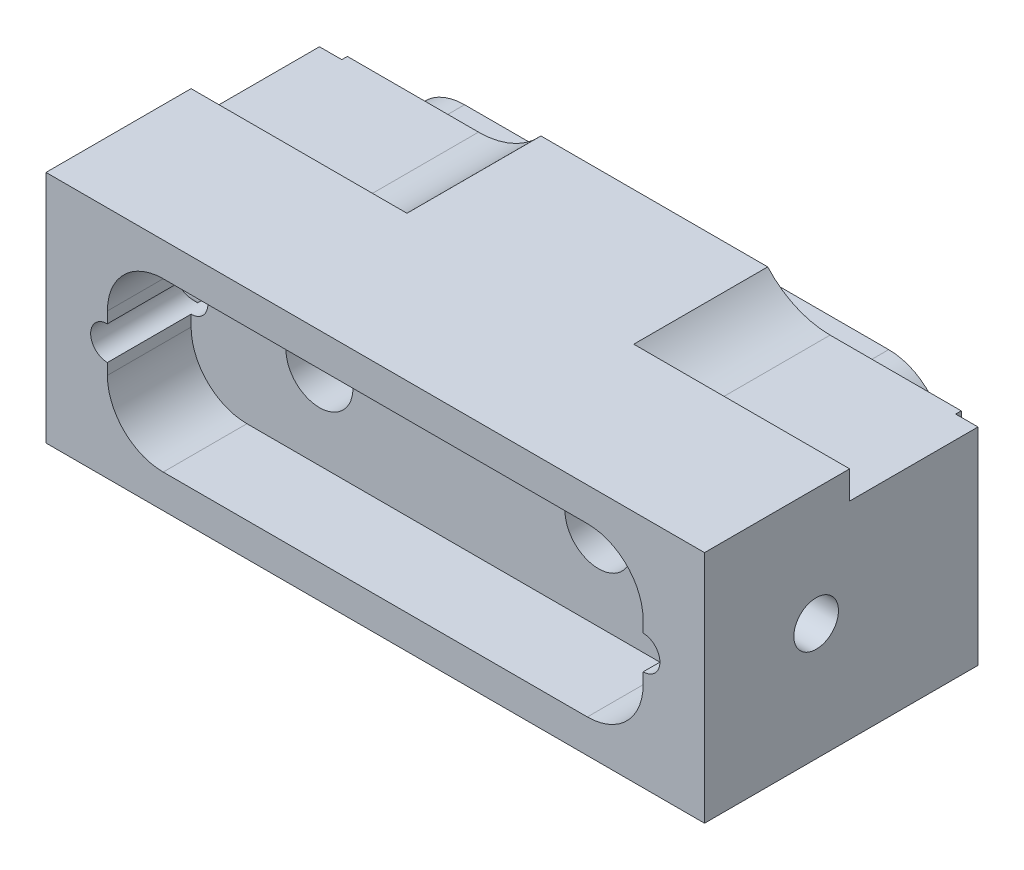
ISO-10303-21;
HEADER;
FILE_DESCRIPTION(('STEP AP214'),'2;1');
FILE_NAME('part.step','',(''),(''),'','','');
FILE_SCHEMA(('AUTOMOTIVE_DESIGN { 1 0 10303 214 1 1 1 1 }'));
ENDSEC;
DATA;
#1=APPLICATION_CONTEXT('core data for automotive mechanical design processes');
#2=APPLICATION_PROTOCOL_DEFINITION('international standard','automotive_design',2000,#1);
#3=PRODUCT_CONTEXT('',#1,'mechanical');
#4=PRODUCT('Part','Part','',(#3));
#5=PRODUCT_RELATED_PRODUCT_CATEGORY('part','',(#4));
#6=PRODUCT_DEFINITION_FORMATION('','',#4);
#7=PRODUCT_DEFINITION_CONTEXT('part definition',#1,'design');
#8=PRODUCT_DEFINITION('design','',#6,#7);
#9=PRODUCT_DEFINITION_SHAPE('','',#8);
#10=(LENGTH_UNIT() NAMED_UNIT(*) SI_UNIT(.MILLI.,.METRE.));
#11=(NAMED_UNIT(*) PLANE_ANGLE_UNIT() SI_UNIT($,.RADIAN.));
#12=(NAMED_UNIT(*) SI_UNIT($,.STERADIAN.) SOLID_ANGLE_UNIT());
#13=UNCERTAINTY_MEASURE_WITH_UNIT(LENGTH_MEASURE(1.E-05),#10,'distance_accuracy_value','');
#14=(GEOMETRIC_REPRESENTATION_CONTEXT(3) GLOBAL_UNCERTAINTY_ASSIGNED_CONTEXT((#13)) GLOBAL_UNIT_ASSIGNED_CONTEXT((#10,
#11,#12)) REPRESENTATION_CONTEXT('',''));
#15=CARTESIAN_POINT('',(0.,0.,0.));
#16=DIRECTION('',(0.,0.,1.));
#17=DIRECTION('',(1.,0.,0.));
#18=AXIS2_PLACEMENT_3D('',#15,#16,#17);
#19=CARTESIAN_POINT('',(-22.9999999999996,-2.18283300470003E-08,-4.001));
#20=DIRECTION('',(0.,0.,1.));
#21=DIRECTION('',(0.,-1.,0.));
#22=AXIS2_PLACEMENT_3D('',#19,#20,#21);
#23=CYLINDRICAL_SURFACE('',#22,3.);
#24=CARTESIAN_POINT('',(-23.0000000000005,2.52390235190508E-06,35.));
#25=DIRECTION('',(0.,0.,-1.));
#26=DIRECTION('',(0.,-1.,0.));
#27=AXIS2_PLACEMENT_3D('',#24,#25,#26);
#28=CIRCLE('',#27,3.);
#29=CARTESIAN_POINT('',(-23.0000000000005,2.99999997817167,35.));
#30=VERTEX_POINT('',#29);
#31=CARTESIAN_POINT('',(-23.0000000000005,-2.99999747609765,35.));
#32=VERTEX_POINT('',#31);
#33=EDGE_CURVE('E388',#30,#32,#28,.T.);
#34=ORIENTED_EDGE('',*,*,#33,.F.);
#35=DIRECTION('',(0.,0.,1.));
#36=VECTOR('',#35,1.);
#37=CARTESIAN_POINT('',(-23.0000000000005,3.00000252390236,35.));
#38=LINE('',#37,#36);
#39=CARTESIAN_POINT('',(-23.0000000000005,3.00000252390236,50.));
#40=VERTEX_POINT('',#39);
#41=EDGE_CURVE('E451',#30,#40,#38,.T.);
#42=ORIENTED_EDGE('',*,*,#41,.T.);
#43=CARTESIAN_POINT('',(-22.9999999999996,-2.18283300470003E-08,50.));
#44=DIRECTION('',(0.,0.,1.));
#45=DIRECTION('',(0.,-1.,0.));
#46=AXIS2_PLACEMENT_3D('',#43,#44,#45);
#47=CIRCLE('',#46,3.);
#48=CARTESIAN_POINT('',(-23.0000000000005,-2.99999747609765,50.));
#49=VERTEX_POINT('',#48);
#50=EDGE_CURVE('E482',#40,#49,#47,.T.);
#51=ORIENTED_EDGE('',*,*,#50,.T.);
#52=DIRECTION('',(0.,0.,1.));
#53=VECTOR('',#52,1.);
#54=CARTESIAN_POINT('',(-23.0000000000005,-2.99999747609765,35.));
#55=LINE('',#54,#53);
#56=EDGE_CURVE('E424',#32,#49,#55,.T.);
#57=ORIENTED_EDGE('',*,*,#56,.F.);
#58=EDGE_LOOP('',(#34,#42,#51,#57));
#59=FACE_BOUND('',#58,.T.);
#60=DIRECTION('',(0.,0.,1.));
#61=VECTOR('',#60,1.);
#62=CARTESIAN_POINT('',(-23.0000004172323,2.99999997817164,-4.001));
#63=LINE('',#62,#61);
#64=CARTESIAN_POINT('',(-23.0000004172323,2.99999997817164,0.));
#65=VERTEX_POINT('',#64);
#66=CARTESIAN_POINT('',(-23.0000004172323,2.99999997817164,-4.));
#67=VERTEX_POINT('',#66);
#68=EDGE_CURVE('E490',#65,#67,#63,.F.);
#69=ORIENTED_EDGE('',*,*,#68,.T.);
#70=CARTESIAN_POINT('',(-22.9999999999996,-2.18283300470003E-08,-4.));
#71=DIRECTION('',(0.,0.,-1.));
#72=DIRECTION('',(0.,1.,0.));
#73=AXIS2_PLACEMENT_3D('',#70,#71,#72);
#74=CIRCLE('',#73,3.);
#75=CARTESIAN_POINT('',(-23.0000004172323,-3.0000000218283,-4.));
#76=VERTEX_POINT('',#75);
#77=EDGE_CURVE('E485',#76,#67,#74,.F.);
#78=ORIENTED_EDGE('',*,*,#77,.F.);
#79=DIRECTION('',(0.,0.,1.));
#80=VECTOR('',#79,1.);
#81=CARTESIAN_POINT('',(-23.0000004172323,-3.0000000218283,-4.001));
#82=LINE('',#81,#80);
#83=CARTESIAN_POINT('',(-23.0000004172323,-3.0000000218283,0.));
#84=VERTEX_POINT('',#83);
#85=EDGE_CURVE('E488',#76,#84,#82,.T.);
#86=ORIENTED_EDGE('',*,*,#85,.T.);
#87=CARTESIAN_POINT('',(-22.9999999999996,-2.18283300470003E-08,0.));
#88=DIRECTION('',(0.,0.,-1.));
#89=DIRECTION('',(0.,1.,0.));
#90=AXIS2_PLACEMENT_3D('',#87,#88,#89);
#91=CIRCLE('',#90,3.);
#92=EDGE_CURVE('E492',#65,#84,#91,.F.);
#93=ORIENTED_EDGE('',*,*,#92,.F.);
#94=EDGE_LOOP('',(#69,#78,#86,#93));
#95=FACE_BOUND('',#94,.T.);
#96=DIRECTION('',(0.,0.,1.));
#97=VECTOR('',#96,1.);
#98=CARTESIAN_POINT('',(-24.0000003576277,-2.82842702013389,-4.001));
#99=LINE('',#98,#97);
#100=CARTESIAN_POINT('',(-24.0000003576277,-2.82842702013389,32.8284244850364));
#101=VERTEX_POINT('',#100);
#102=CARTESIAN_POINT('',(-24.0000003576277,-2.82842702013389,27.1715755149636));
#103=VERTEX_POINT('',#102);
#104=EDGE_CURVE('E696',#101,#103,#99,.F.);
#105=ORIENTED_EDGE('',*,*,#104,.F.);
#106=CARTESIAN_POINT('',(-24.0000003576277,-2.82842702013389,32.8284244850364));
#107=CARTESIAN_POINT('',(-24.0856667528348,-2.79811739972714,32.8587517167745));
#108=CARTESIAN_POINT('',(-24.1690774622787,-2.76427027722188,32.8916100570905));
#109=CARTESIAN_POINT('',(-24.3312310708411,-2.68994439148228,32.9608665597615));
#110=CARTESIAN_POINT('',(-24.4099793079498,-2.64947341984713,32.9972605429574));
#111=CARTESIAN_POINT('',(-24.5630665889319,-2.56214807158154,33.0722488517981));
#112=CARTESIAN_POINT('',(-24.6373926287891,-2.5152760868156,33.1108490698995));
#113=CARTESIAN_POINT('',(-24.7813467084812,-2.41546643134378,33.1889703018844));
#114=CARTESIAN_POINT('',(-24.8509731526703,-2.36252671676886,33.228491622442));
#115=CARTESIAN_POINT('',(-25.0521066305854,-2.19526996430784,33.3465370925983));
#116=CARTESIAN_POINT('',(-25.1765548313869,-2.07212119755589,33.4248980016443));
#117=CARTESIAN_POINT('',(-25.4038657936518,-1.80341070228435,33.5736882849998));
#118=CARTESIAN_POINT('',(-25.5067634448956,-1.65788587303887,33.6441303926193));
#119=CARTESIAN_POINT('',(-25.6686688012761,-1.37794373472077,33.7575505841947));
#120=CARTESIAN_POINT('',(-25.7323482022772,-1.24732522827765,33.8031995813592));
#121=CARTESIAN_POINT('',(-25.8409397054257,-0.974939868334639,33.8819493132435));
#122=CARTESIAN_POINT('',(-25.8858664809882,-0.833181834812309,33.9150598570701));
#123=CARTESIAN_POINT('',(-25.9546650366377,-0.540933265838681,33.9660436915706));
#124=CARTESIAN_POINT('',(-25.9784018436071,-0.390393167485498,33.9838192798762));
#125=CARTESIAN_POINT('',(-26.0026229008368,-0.0864119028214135,34.0019588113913));
#126=CARTESIAN_POINT('',(-26.0031161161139,0.0670281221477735,34.0023294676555));
#127=CARTESIAN_POINT('',(-25.9820149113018,0.355400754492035,33.9865249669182));
#128=CARTESIAN_POINT('',(-25.9627006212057,0.490605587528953,33.9720578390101));
#129=CARTESIAN_POINT('',(-25.9065327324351,0.755227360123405,33.9303414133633));
#130=CARTESIAN_POINT('',(-25.8696778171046,0.884643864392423,33.9030911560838));
#131=CARTESIAN_POINT('',(-25.7788101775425,1.13886835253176,33.8367691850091));
#132=CARTESIAN_POINT('',(-25.7242955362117,1.26340445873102,33.7973534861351));
#133=CARTESIAN_POINT('',(-25.6006313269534,1.50158264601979,33.7096350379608));
#134=CARTESIAN_POINT('',(-25.531472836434,1.61521802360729,33.6613268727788));
#135=CARTESIAN_POINT('',(-25.3678830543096,1.84842054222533,33.5500278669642));
#136=CARTESIAN_POINT('',(-25.2711625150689,1.96584520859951,33.4859307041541));
#137=CARTESIAN_POINT('',(-25.0625186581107,2.18375804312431,33.3537212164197));
#138=CARTESIAN_POINT('',(-24.9505888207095,2.28423890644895,33.2856071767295));
#139=CARTESIAN_POINT('',(-24.7698588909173,2.42357010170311,33.1827423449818));
#140=CARTESIAN_POINT('',(-24.7061170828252,2.4688674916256,33.1476566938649));
#141=CARTESIAN_POINT('',(-24.57490222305,2.55456877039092,33.0785093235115));
#142=CARTESIAN_POINT('',(-24.5074301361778,2.59497391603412,33.0444473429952));
#143=CARTESIAN_POINT('',(-24.368793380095,2.67070152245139,32.9782364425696));
#144=CARTESIAN_POINT('',(-24.2976292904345,2.70602477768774,32.9460872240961));
#145=CARTESIAN_POINT('',(-24.1515801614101,2.77132609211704,32.8847521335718));
#146=CARTESIAN_POINT('',(-24.0766915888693,2.80129894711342,32.8555691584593));
#147=CARTESIAN_POINT('',(-24.0000003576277,2.82842697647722,32.8284300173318));
#148=B_SPLINE_CURVE_WITH_KNOTS('',3,(#106,#107,#108,#109,#110,#111,#112,#113,#114,#115,#116,
#117,#118,#119,#120,#121,#122,#123,#124,#125,#126,#127,#128,#129,#130,#131,#132,#133,#134,#135,
#136,#137,#138,#139,#140,#141,#142,#143,#144,#145,#146,#147),.UNSPECIFIED.,.F.,.F.,(4,2,2,2,2,2,
2,2,2,2,2,2,2,2,2,2,2,2,2,2,4),(0.,0.28712761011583,0.573919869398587,0.861517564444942,
1.14921242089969,1.72202682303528,2.29390655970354,2.74902127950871,3.20377921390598,
3.66141355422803,4.11887138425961,4.52899599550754,4.93915139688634,5.3621718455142,
5.78545078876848,6.2789382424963,6.77263790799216,7.02957736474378,7.28645067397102,
7.54328378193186,7.80036535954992),.UNSPECIFIED.);
#149=CARTESIAN_POINT('',(-24.0000003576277,2.82842697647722,32.8284300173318));
#150=VERTEX_POINT('',#149);
#151=EDGE_CURVE('E682',#101,#150,#148,.T.);
#152=ORIENTED_EDGE('',*,*,#151,.T.);
#153=DIRECTION('',(0.,0.,1.));
#154=VECTOR('',#153,1.);
#155=CARTESIAN_POINT('',(-24.0000003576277,2.82842697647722,-4.001));
#156=LINE('',#155,#154);
#157=CARTESIAN_POINT('',(-24.0000003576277,2.82842697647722,27.1715699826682));
#158=VERTEX_POINT('',#157);
#159=EDGE_CURVE('E1125',#158,#150,#156,.T.);
#160=ORIENTED_EDGE('',*,*,#159,.F.);
#161=CARTESIAN_POINT('',(-24.0000003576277,2.82842697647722,27.1715699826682));
#162=CARTESIAN_POINT('',(-24.0856667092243,2.79811737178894,27.1412428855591));
#163=CARTESIAN_POINT('',(-24.1690773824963,2.76427026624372,27.108384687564));
#164=CARTESIAN_POINT('',(-24.331230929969,2.6899444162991,27.0391284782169));
#165=CARTESIAN_POINT('',(-24.4099791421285,2.64947346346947,27.0027346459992));
#166=CARTESIAN_POINT('',(-24.5630663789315,2.56214815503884,26.9277466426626));
#167=CARTESIAN_POINT('',(-24.6373923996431,2.51527619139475,26.8891465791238));
#168=CARTESIAN_POINT('',(-24.7813464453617,2.41546658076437,26.8110256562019));
#169=CARTESIAN_POINT('',(-24.8509728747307,2.36252688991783,26.7715044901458));
#170=CARTESIAN_POINT('',(-25.0521063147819,2.19527021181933,26.6534594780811));
#171=CARTESIAN_POINT('',(-25.1765544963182,2.07212150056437,26.5750988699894));
#172=CARTESIAN_POINT('',(-25.4038654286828,1.8034111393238,26.4263091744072));
#173=CARTESIAN_POINT('',(-25.50676306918,1.65788638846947,26.3558673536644));
#174=CARTESIAN_POINT('',(-25.6686684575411,1.37794435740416,26.242447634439));
#175=CARTESIAN_POINT('',(-25.7323478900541,1.24732586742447,26.1967988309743));
#176=CARTESIAN_POINT('',(-25.8409394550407,0.974940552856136,26.1180494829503));
#177=CARTESIAN_POINT('',(-25.8858662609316,0.833182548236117,26.0849391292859));
#178=CARTESIAN_POINT('',(-25.9546648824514,0.540934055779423,26.0339556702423));
#179=CARTESIAN_POINT('',(-25.9784017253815,0.390394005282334,26.0161802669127));
#180=CARTESIAN_POINT('',(-26.0026228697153,0.0864128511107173,25.9980410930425));
#181=CARTESIAN_POINT('',(-26.0031161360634,-0.0670271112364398,25.9976706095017));
#182=CARTESIAN_POINT('',(-25.9820150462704,-0.355399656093,26.0134754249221));
#183=CARTESIAN_POINT('',(-25.9627008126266,-0.490604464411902,26.0279427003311));
#184=CARTESIAN_POINT('',(-25.9065330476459,-0.755226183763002,26.0696594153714));
#185=CARTESIAN_POINT('',(-25.8696781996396,-0.884642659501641,26.0969098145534));
#186=CARTESIAN_POINT('',(-25.7788106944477,-1.13886713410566,26.1632320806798));
#187=CARTESIAN_POINT('',(-25.7242961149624,-1.26340325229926,26.2026479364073));
#188=CARTESIAN_POINT('',(-25.600632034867,-1.501581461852,26.2903667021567));
#189=CARTESIAN_POINT('',(-25.5314736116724,-1.61521684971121,26.3386750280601));
#190=CARTESIAN_POINT('',(-25.3678839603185,-1.84841942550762,26.4499744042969));
#191=CARTESIAN_POINT('',(-25.2711634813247,-1.96584413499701,26.5140717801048));
#192=CARTESIAN_POINT('',(-25.0625197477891,-2.18375705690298,26.6462817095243));
#193=CARTESIAN_POINT('',(-24.9505899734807,-2.28423796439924,26.7143959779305));
#194=CARTESIAN_POINT('',(-24.7698600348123,-2.42356931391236,26.8172612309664));
#195=CARTESIAN_POINT('',(-24.7061181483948,-2.46886680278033,26.8523470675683));
#196=CARTESIAN_POINT('',(-24.5749031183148,-2.55456826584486,26.9214948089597));
#197=CARTESIAN_POINT('',(-24.5074309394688,-2.59497349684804,26.9555569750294));
#198=CARTESIAN_POINT('',(-24.3687939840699,-2.67070126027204,27.0217682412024));
#199=CARTESIAN_POINT('',(-24.297629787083,-2.7060245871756,27.0539176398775));
#200=CARTESIAN_POINT('',(-24.151580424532,-2.77132603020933,27.1152530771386));
#201=CARTESIAN_POINT('',(-24.0766917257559,-2.80129894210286,27.1444362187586));
#202=CARTESIAN_POINT('',(-24.0000003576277,-2.82842702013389,27.1715755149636));
#203=B_SPLINE_CURVE_WITH_KNOTS('',3,(#161,#162,#163,#164,#165,#166,#167,#168,#169,#170,#171,
#172,#173,#174,#175,#176,#177,#178,#179,#180,#181,#182,#183,#184,#185,#186,#187,#188,#189,#190,
#191,#192,#193,#194,#195,#196,#197,#198,#199,#200,#201,#202),.UNSPECIFIED.,.F.,.F.,(4,2,2,2,2,2,
2,2,2,2,2,2,2,2,2,2,2,2,2,2,4),(0.,0.287127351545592,0.573919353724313,0.86151678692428,
1.14921138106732,1.72202527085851,2.29390449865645,2.74901904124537,3.20377679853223,
3.66141095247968,4.11886859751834,4.52899315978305,4.93914851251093,5.3621690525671,
5.78544808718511,6.27893577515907,6.7726356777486,7.02957569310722,7.28644956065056,
7.5432832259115,7.80036536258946),.UNSPECIFIED.);
#204=EDGE_CURVE('E689',#158,#103,#203,.T.);
#205=ORIENTED_EDGE('',*,*,#204,.T.);
#206=EDGE_LOOP('',(#105,#152,#160,#205));
#207=FACE_BOUND('',#206,.T.);
#208=ADVANCED_FACE('F14',(#59,#95,#207),#23,.F.);
#209=CARTESIAN_POINT('',(73.,2.90882505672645E-06,-4.001));
#210=DIRECTION('',(0.,0.,1.));
#211=DIRECTION('',(0.,-1.,0.));
#212=AXIS2_PLACEMENT_3D('',#209,#210,#211);
#213=CYLINDRICAL_SURFACE('',#212,3.);
#214=DIRECTION('',(0.,0.,1.));
#215=VECTOR('',#214,1.);
#216=CARTESIAN_POINT('',(72.9999995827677,-2.99999709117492,-4.001));
#217=LINE('',#216,#215);
#218=CARTESIAN_POINT('',(72.9999995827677,-2.99999709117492,0.));
#219=VERTEX_POINT('',#218);
#220=CARTESIAN_POINT('',(72.9999995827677,-2.99999709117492,-4.));
#221=VERTEX_POINT('',#220);
#222=EDGE_CURVE('E503',#219,#221,#217,.F.);
#223=ORIENTED_EDGE('',*,*,#222,.T.);
#224=CARTESIAN_POINT('',(73.,2.90882505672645E-06,-4.));
#225=DIRECTION('',(0.,0.,-1.));
#226=DIRECTION('',(0.,1.,0.));
#227=AXIS2_PLACEMENT_3D('',#224,#225,#226);
#228=CIRCLE('',#227,3.);
#229=CARTESIAN_POINT('',(72.9999995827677,3.00000290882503,-4.));
#230=VERTEX_POINT('',#229);
#231=EDGE_CURVE('E498',#230,#221,#228,.F.);
#232=ORIENTED_EDGE('',*,*,#231,.F.);
#233=DIRECTION('',(0.,0.,1.));
#234=VECTOR('',#233,1.);
#235=CARTESIAN_POINT('',(72.9999995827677,3.00000290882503,-4.001));
#236=LINE('',#235,#234);
#237=CARTESIAN_POINT('',(72.9999995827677,3.00000290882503,0.));
#238=VERTEX_POINT('',#237);
#239=EDGE_CURVE('E501',#230,#238,#236,.T.);
#240=ORIENTED_EDGE('',*,*,#239,.T.);
#241=CARTESIAN_POINT('',(73.,2.90882505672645E-06,0.));
#242=DIRECTION('',(0.,0.,-1.));
#243=DIRECTION('',(0.,1.,0.));
#244=AXIS2_PLACEMENT_3D('',#241,#242,#243);
#245=CIRCLE('',#244,3.);
#246=EDGE_CURVE('E505',#219,#238,#245,.F.);
#247=ORIENTED_EDGE('',*,*,#246,.F.);
#248=EDGE_LOOP('',(#223,#232,#240,#247));
#249=FACE_BOUND('',#248,.T.);
#250=CARTESIAN_POINT('',(73.,2.90882505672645E-06,50.));
#251=DIRECTION('',(0.,0.,1.));
#252=DIRECTION('',(0.,-1.,0.));
#253=AXIS2_PLACEMENT_3D('',#250,#251,#252);
#254=CIRCLE('',#253,3.);
#255=CARTESIAN_POINT('',(73.,-2.99999709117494,50.));
#256=VERTEX_POINT('',#255);
#257=CARTESIAN_POINT('',(73.,3.00000290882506,50.));
#258=VERTEX_POINT('',#257);
#259=EDGE_CURVE('E495',#256,#258,#254,.T.);
#260=ORIENTED_EDGE('',*,*,#259,.T.);
#261=DIRECTION('',(0.,0.,1.));
#262=VECTOR('',#261,1.);
#263=CARTESIAN_POINT('',(73.,3.00000290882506,35.));
#264=LINE('',#263,#262);
#265=CARTESIAN_POINT('',(73.,3.00000290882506,35.));
#266=VERTEX_POINT('',#265);
#267=EDGE_CURVE('E463',#266,#258,#264,.T.);
#268=ORIENTED_EDGE('',*,*,#267,.F.);
#269=CARTESIAN_POINT('',(73.,2.90882505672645E-06,35.));
#270=DIRECTION('',(0.,0.,-1.));
#271=DIRECTION('',(0.,-1.,0.));
#272=AXIS2_PLACEMENT_3D('',#269,#270,#271);
#273=CIRCLE('',#272,3.);
#274=CARTESIAN_POINT('',(73.,-2.99999709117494,35.));
#275=VERTEX_POINT('',#274);
#276=EDGE_CURVE('E407',#275,#266,#273,.T.);
#277=ORIENTED_EDGE('',*,*,#276,.F.);
#278=DIRECTION('',(0.,0.,1.));
#279=VECTOR('',#278,1.);
#280=CARTESIAN_POINT('',(73.,-2.99999709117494,35.));
#281=LINE('',#280,#279);
#282=EDGE_CURVE('E465',#275,#256,#281,.T.);
#283=ORIENTED_EDGE('',*,*,#282,.T.);
#284=EDGE_LOOP('',(#260,#268,#277,#283));
#285=FACE_BOUND('',#284,.T.);
#286=DIRECTION('',(0.,0.,1.));
#287=VECTOR('',#286,1.);
#288=CARTESIAN_POINT('',(73.9999996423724,2.82843016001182,-4.001));
#289=LINE('',#288,#287);
#290=CARTESIAN_POINT('',(73.9999996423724,2.82843016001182,32.8284268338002));
#291=VERTEX_POINT('',#290);
#292=CARTESIAN_POINT('',(73.9999996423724,2.82843016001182,27.1715731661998));
#293=VERTEX_POINT('',#292);
#294=EDGE_CURVE('E1120',#291,#293,#289,.F.);
#295=ORIENTED_EDGE('',*,*,#294,.F.);
#296=CARTESIAN_POINT('',(73.9999996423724,2.82843016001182,32.8284268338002));
#297=CARTESIAN_POINT('',(74.0856660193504,2.79812057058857,32.8587539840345));
#298=CARTESIAN_POINT('',(74.16907671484,2.76427347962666,32.8916122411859));
#299=CARTESIAN_POINT('',(74.3312303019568,2.68994765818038,32.9608685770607));
#300=CARTESIAN_POINT('',(74.4099785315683,2.64947671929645,32.9972624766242));
#301=CARTESIAN_POINT('',(74.5630658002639,2.56215143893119,33.0722506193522));
#302=CARTESIAN_POINT('',(74.6373918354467,2.51527948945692,33.1108507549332));
#303=CARTESIAN_POINT('',(74.7813459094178,2.41546990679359,33.1889718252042));
#304=CARTESIAN_POINT('',(74.8509723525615,2.36253022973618,33.2284930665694));
#305=CARTESIAN_POINT('',(75.0521058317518,2.19527359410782,33.346538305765));
#306=CARTESIAN_POINT('',(75.1765540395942,2.0721249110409,33.424899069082));
#307=CARTESIAN_POINT('',(75.4038650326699,1.80341459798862,33.5736890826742));
#308=CARTESIAN_POINT('',(75.5067627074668,1.65788986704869,33.6441310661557));
#309=CARTESIAN_POINT('',(75.6686681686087,1.37794784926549,33.7575510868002));
#310=CARTESIAN_POINT('',(75.7323476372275,1.24732935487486,33.8032000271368));
#311=CARTESIAN_POINT('',(75.8409392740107,0.9749440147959,33.8819496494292));
#312=CARTESIAN_POINT('',(75.8858661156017,0.833185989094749,33.9150601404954));
#313=CARTESIAN_POINT('',(75.9546648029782,0.540937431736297,33.9660438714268));
#314=CARTESIAN_POINT('',(75.9784016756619,0.390397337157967,33.9838194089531));
#315=CARTESIAN_POINT('',(76.00262286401,0.0864160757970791,34.0019588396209));
#316=CARTESIAN_POINT('',(76.0031161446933,-0.0670239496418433,34.0023294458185));
#317=CARTESIAN_POINT('',(75.9820150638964,-0.355396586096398,33.9865248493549));
#318=CARTESIAN_POINT('',(75.9627008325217,-0.490601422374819,33.9720576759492));
#319=CARTESIAN_POINT('',(75.9065330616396,-0.755223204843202,33.9303411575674));
#320=CARTESIAN_POINT('',(75.8696782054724,-0.884639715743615,33.9030908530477));
#321=CARTESIAN_POINT('',(75.7788106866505,-1.13886422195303,33.8367687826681));
#322=CARTESIAN_POINT('',(75.724296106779,-1.26340033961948,33.7973530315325));
#323=CARTESIAN_POINT('',(75.6006320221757,-1.50157855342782,33.7096344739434));
#324=CARTESIAN_POINT('',(75.5314735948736,-1.61521394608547,33.6613262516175));
#325=CARTESIAN_POINT('',(75.3678839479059,-1.84841650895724,33.5500271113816));
#326=CARTESIAN_POINT('',(75.2711634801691,-1.96584120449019,33.4859298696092));
#327=CARTESIAN_POINT('',(75.0625197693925,-2.1837541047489,33.3537202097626));
#328=CARTESIAN_POINT('',(74.9505900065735,-2.28423500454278,33.2856060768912));
#329=CARTESIAN_POINT('',(74.7698600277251,-2.4235663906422,33.1827409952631));
#330=CARTESIAN_POINT('',(74.7061180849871,-2.46886391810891,33.1476551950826));
#331=CARTESIAN_POINT('',(74.5749029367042,-2.55456544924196,33.0785075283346));
#332=CARTESIAN_POINT('',(74.5074306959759,-2.59497070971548,33.0444454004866));
#333=CARTESIAN_POINT('',(74.3687936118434,-2.67069852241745,32.9782342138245));
#334=CARTESIAN_POINT('',(74.2976293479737,-2.70602186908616,32.9460848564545));
#335=CARTESIAN_POINT('',(74.1515798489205,-2.77132334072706,32.8847495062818));
#336=CARTESIAN_POINT('',(74.0766910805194,-2.80129626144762,32.8555664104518));
#337=CARTESIAN_POINT('',(73.9999996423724,-2.8284243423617,32.828427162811));
#338=B_SPLINE_CURVE_WITH_KNOTS('',3,(#296,#297,#298,#299,#300,#301,#302,#303,#304,#305,#306,
#307,#308,#309,#310,#311,#312,#313,#314,#315,#316,#317,#318,#319,#320,#321,#322,#323,#324,#325,
#326,#327,#328,#329,#330,#331,#332,#333,#334,#335,#336,#337),.UNSPECIFIED.,.F.,.F.,(4,2,2,2,2,2,
2,2,2,2,2,2,2,2,2,2,2,2,2,2,4),(0.,0.287127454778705,0.57391955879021,0.861517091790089,
1.14921178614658,1.7220258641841,2.29390528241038,2.74902000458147,3.20377794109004,
3.66141228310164,4.1188701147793,4.5289947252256,4.93915012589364,5.36217057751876,
5.78544952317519,6.27893700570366,6.772636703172,7.02957686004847,7.28645086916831,
7.54328467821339,7.80036695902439),.UNSPECIFIED.);
#339=CARTESIAN_POINT('',(73.9999996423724,-2.8284243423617,32.828427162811));
#340=VERTEX_POINT('',#339);
#341=EDGE_CURVE('E605',#291,#340,#338,.T.);
#342=ORIENTED_EDGE('',*,*,#341,.T.);
#343=DIRECTION('',(0.,0.,1.));
#344=VECTOR('',#343,1.);
#345=CARTESIAN_POINT('',(73.9999996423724,-2.8284243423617,-4.001));
#346=LINE('',#345,#344);
#347=CARTESIAN_POINT('',(73.9999996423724,-2.8284243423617,27.171572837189));
#348=VERTEX_POINT('',#347);
#349=EDGE_CURVE('E603',#348,#340,#346,.T.);
#350=ORIENTED_EDGE('',*,*,#349,.F.);
#351=CARTESIAN_POINT('',(73.9999996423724,-2.8284243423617,27.171572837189));
#352=CARTESIAN_POINT('',(74.0856660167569,-2.79811475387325,27.1412456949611));
#353=CARTESIAN_POINT('',(74.1690767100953,-2.76426766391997,27.1083874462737));
#354=CARTESIAN_POINT('',(74.331230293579,-2.68994184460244,27.0391311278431));
#355=CARTESIAN_POINT('',(74.4099785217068,-2.64947090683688,27.0027372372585));
#356=CARTESIAN_POINT('',(74.563065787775,-2.56214562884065,26.9277491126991));
#357=CARTESIAN_POINT('',(74.6373918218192,-2.51527368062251,26.8891489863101));
#358=CARTESIAN_POINT('',(74.7813458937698,-2.41546410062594,26.8110279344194));
#359=CARTESIAN_POINT('',(74.8509723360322,-2.36252442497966,26.7715067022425));
#360=CARTESIAN_POINT('',(75.0521058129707,-2.1952677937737,26.65346149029));
#361=CARTESIAN_POINT('',(75.1765540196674,-2.07211911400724,26.5751007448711));
#362=CARTESIAN_POINT('',(75.4038650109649,-1.80340880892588,26.4263107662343));
#363=CARTESIAN_POINT('',(75.5067626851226,-1.65788408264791,26.3558687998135));
#364=CARTESIAN_POINT('',(75.6686681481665,-1.37794207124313,26.2424488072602));
#365=CARTESIAN_POINT('',(75.7323476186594,-1.24732357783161,26.196799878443));
#366=CARTESIAN_POINT('',(75.8409392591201,-0.974938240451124,26.1180502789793));
#367=CARTESIAN_POINT('',(75.8858661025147,-0.833180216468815,26.0849397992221));
#368=CARTESIAN_POINT('',(75.9546647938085,-0.540931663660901,26.0339560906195));
#369=CARTESIAN_POINT('',(75.9784016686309,-0.390391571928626,26.0161805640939));
#370=CARTESIAN_POINT('',(76.0026228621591,-0.086410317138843,25.9980411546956));
#371=CARTESIAN_POINT('',(76.0031161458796,0.0670297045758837,25.9976705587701));
#372=CARTESIAN_POINT('',(75.982015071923,0.355402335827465,26.0134751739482));
#373=CARTESIAN_POINT('',(75.9627008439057,0.490607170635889,26.0279423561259));
#374=CARTESIAN_POINT('',(75.9065330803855,0.755228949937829,26.0696588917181));
#375=CARTESIAN_POINT('',(75.8696782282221,0.884645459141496,26.0969092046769));
#376=CARTESIAN_POINT('',(75.7788107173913,1.13886996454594,26.1632312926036));
#377=CARTESIAN_POINT('',(75.7242961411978,1.26340608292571,26.2026470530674));
#378=CARTESIAN_POINT('',(75.600632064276,1.50158429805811,26.290365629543));
#379=CARTESIAN_POINT('',(75.5314736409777,1.61521969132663,26.3386738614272));
#380=CARTESIAN_POINT('',(75.3678840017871,1.84842225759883,26.4499730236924));
#381=CARTESIAN_POINT('',(75.2711635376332,1.96584695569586,26.5140702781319));
#382=CARTESIAN_POINT('',(75.0625198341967,2.1837598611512,26.6462799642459));
#383=CARTESIAN_POINT('',(74.9505900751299,2.28424076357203,26.7143941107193));
#384=CARTESIAN_POINT('',(74.7698600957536,2.42357215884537,26.8172592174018));
#385=CARTESIAN_POINT('',(74.7061181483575,2.46886969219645,26.8523450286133));
#386=CARTESIAN_POINT('',(74.5749029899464,2.55457123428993,26.9214927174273));
#387=CARTESIAN_POINT('',(74.5074307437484,2.5949764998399,26.9555548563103));
#388=CARTESIAN_POINT('',(74.3687936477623,2.67070432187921,27.0217660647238));
#389=CARTESIAN_POINT('',(74.2976293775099,2.70602767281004,27.0539154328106));
#390=CARTESIAN_POINT('',(74.1515798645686,2.77132915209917,27.1152508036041));
#391=CARTESIAN_POINT('',(74.0766910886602,2.80130207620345,27.1444339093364));
#392=CARTESIAN_POINT('',(73.9999996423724,2.82843016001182,27.1715731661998));
#393=B_SPLINE_CURVE_WITH_KNOTS('',3,(#351,#352,#353,#354,#355,#356,#357,#358,#359,#360,#361,
#362,#363,#364,#365,#366,#367,#368,#369,#370,#371,#372,#373,#374,#375,#376,#377,#378,#379,#380,
#381,#382,#383,#384,#385,#386,#387,#388,#389,#390,#391,#392),.UNSPECIFIED.,.F.,.F.,(4,2,2,2,2,2,
2,2,2,2,2,2,2,2,2,2,2,2,2,2,4),(0.,0.287127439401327,0.573919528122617,0.861517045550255,
1.14921172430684,1.72202577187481,2.29390515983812,2.74901987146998,3.2037777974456,
3.6614121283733,4.11886994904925,4.52899455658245,4.93914995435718,5.3621704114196,
5.78544936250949,6.27893685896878,6.77263657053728,7.02957676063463,7.28645080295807,
7.54328464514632,7.80036695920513),.UNSPECIFIED.);
#394=EDGE_CURVE('E614',#348,#293,#393,.T.);
#395=ORIENTED_EDGE('',*,*,#394,.T.);
#396=EDGE_LOOP('',(#295,#342,#350,#395));
#397=FACE_BOUND('',#396,.T.);
#398=ADVANCED_FACE('F620',(#249,#285,#397),#213,.F.);
#399=CARTESIAN_POINT('',(50.,2.74431966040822E-06,50.));
#400=DIRECTION('',(0.,0.,-1.));
#401=DIRECTION('',(0.,1.,0.));
#402=AXIS2_PLACEMENT_3D('',#399,#400,#401);
#403=CYLINDRICAL_SURFACE('',#402,6.);
#404=CARTESIAN_POINT('',(50.,2.74431966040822E-06,-4.));
#405=DIRECTION('',(0.,0.,-1.));
#406=DIRECTION('',(0.,1.,0.));
#407=AXIS2_PLACEMENT_3D('',#404,#405,#406);
#408=CIRCLE('',#407,6.);
#409=CARTESIAN_POINT('',(50.,6.00000274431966,-4.));
#410=VERTEX_POINT('',#409);
#411=EDGE_CURVE('E508',#410,#410,#408,.F.);
#412=ORIENTED_EDGE('',*,*,#411,.F.);
#413=EDGE_LOOP('',(#412));
#414=FACE_BOUND('',#413,.T.);
#415=CARTESIAN_POINT('',(50.,2.74431966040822E-06,35.));
#416=DIRECTION('',(0.,0.,1.));
#417=DIRECTION('',(0.,-1.,0.));
#418=AXIS2_PLACEMENT_3D('',#415,#416,#417);
#419=CIRCLE('',#418,6.);
#420=CARTESIAN_POINT('',(50.,-5.99999725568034,35.));
#421=VERTEX_POINT('',#420);
#422=EDGE_CURVE('E479',#421,#421,#419,.T.);
#423=ORIENTED_EDGE('',*,*,#422,.T.);
#424=EDGE_LOOP('',(#423));
#425=FACE_BOUND('',#424,.T.);
#426=ADVANCED_FACE('F1038',(#414,#425),#403,.F.);
#427=CARTESIAN_POINT('',(0.,0.,50.));
#428=DIRECTION('',(0.,0.,-1.));
#429=DIRECTION('',(0.,1.,0.));
#430=AXIS2_PLACEMENT_3D('',#427,#428,#429);
#431=CYLINDRICAL_SURFACE('',#430,6.);
#432=CARTESIAN_POINT('',(0.,0.,-4.));
#433=DIRECTION('',(0.,0.,-1.));
#434=DIRECTION('',(0.,1.,0.));
#435=AXIS2_PLACEMENT_3D('',#432,#433,#434);
#436=CIRCLE('',#435,6.);
#437=CARTESIAN_POINT('',(0.,6.,-4.));
#438=VERTEX_POINT('',#437);
#439=EDGE_CURVE('E511',#438,#438,#436,.F.);
#440=ORIENTED_EDGE('',*,*,#439,.F.);
#441=EDGE_LOOP('',(#440));
#442=FACE_BOUND('',#441,.T.);
#443=CARTESIAN_POINT('',(0.,0.,35.));
#444=DIRECTION('',(0.,0.,1.));
#445=DIRECTION('',(0.,-1.,0.));
#446=AXIS2_PLACEMENT_3D('',#443,#444,#445);
#447=CIRCLE('',#446,6.);
#448=CARTESIAN_POINT('',(0.,-6.,35.));
#449=VERTEX_POINT('',#448);
#450=EDGE_CURVE('E454',#449,#449,#447,.T.);
#451=ORIENTED_EDGE('',*,*,#450,.T.);
#452=EDGE_LOOP('',(#451));
#453=FACE_BOUND('',#452,.T.);
#454=ADVANCED_FACE('F1030',(#442,#453),#431,.F.);
#455=CARTESIAN_POINT('',(-23.0000004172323,-4.9999985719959,-4.));
#456=DIRECTION('',(1.,0.,0.));
#457=DIRECTION('',(0.,1.,0.));
#458=AXIS2_PLACEMENT_3D('',#455,#456,#457);
#459=PLANE('',#458);
#460=DIRECTION('',(0.,1.,0.));
#461=VECTOR('',#460,1.);
#462=CARTESIAN_POINT('',(-23.0000004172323,-4.9999985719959,-4.));
#463=LINE('',#462,#461);
#464=CARTESIAN_POINT('',(-23.0000004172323,5.0000014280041,-4.));
#465=VERTEX_POINT('',#464);
#466=EDGE_CURVE('E533',#67,#465,#463,.T.);
#467=ORIENTED_EDGE('',*,*,#466,.F.);
#468=ORIENTED_EDGE('',*,*,#68,.F.);
#469=DIRECTION('',(0.,1.,0.));
#470=VECTOR('',#469,1.);
#471=CARTESIAN_POINT('',(-23.0000004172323,-4.9999985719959,0.));
#472=LINE('',#471,#470);
#473=CARTESIAN_POINT('',(-23.0000004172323,5.0000014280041,0.));
#474=VERTEX_POINT('',#473);
#475=EDGE_CURVE('E555',#65,#474,#472,.T.);
#476=ORIENTED_EDGE('',*,*,#475,.T.);
#477=DIRECTION('',(0.,0.,1.));
#478=VECTOR('',#477,1.);
#479=CARTESIAN_POINT('',(-23.0000004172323,5.0000014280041,-4.));
#480=LINE('',#479,#478);
#481=EDGE_CURVE('E537',#465,#474,#480,.T.);
#482=ORIENTED_EDGE('',*,*,#481,.F.);
#483=EDGE_LOOP('',(#467,#468,#476,#482));
#484=FACE_BOUND('',#483,.T.);
#485=ADVANCED_FACE('F904',(#484),#459,.F.);
#486=CARTESIAN_POINT('',(72.9999995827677,5.00000104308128,-4.));
#487=DIRECTION('',(-1.,0.,0.));
#488=DIRECTION('',(0.,0.,-1.));
#489=AXIS2_PLACEMENT_3D('',#486,#487,#488);
#490=PLANE('',#489);
#491=DIRECTION('',(0.,-1.,0.));
#492=VECTOR('',#491,1.);
#493=CARTESIAN_POINT('',(72.9999995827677,5.00000104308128,-4.));
#494=LINE('',#493,#492);
#495=CARTESIAN_POINT('',(72.9999995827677,-4.99999895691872,-4.));
#496=VERTEX_POINT('',#495);
#497=EDGE_CURVE('E523',#221,#496,#494,.T.);
#498=ORIENTED_EDGE('',*,*,#497,.F.);
#499=ORIENTED_EDGE('',*,*,#222,.F.);
#500=DIRECTION('',(0.,-1.,0.));
#501=VECTOR('',#500,1.);
#502=CARTESIAN_POINT('',(72.9999995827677,5.00000104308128,0.));
#503=LINE('',#502,#501);
#504=CARTESIAN_POINT('',(72.9999995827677,-4.99999895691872,0.));
#505=VERTEX_POINT('',#504);
#506=EDGE_CURVE('E544',#219,#505,#503,.T.);
#507=ORIENTED_EDGE('',*,*,#506,.T.);
#508=DIRECTION('',(0.,0.,1.));
#509=VECTOR('',#508,1.);
#510=CARTESIAN_POINT('',(72.9999995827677,-4.99999895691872,-4.));
#511=LINE('',#510,#509);
#512=EDGE_CURVE('E568',#496,#505,#511,.T.);
#513=ORIENTED_EDGE('',*,*,#512,.F.);
#514=EDGE_LOOP('',(#498,#499,#507,#513));
#515=FACE_BOUND('',#514,.T.);
#516=ADVANCED_FACE('F941',(#515),#490,.F.);
#517=CARTESIAN_POINT('',(-34.0000003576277,20.9999996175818,0.));
#518=DIRECTION('',(0.,0.,-1.));
#519=DIRECTION('',(0.,1.,0.));
#520=AXIS2_PLACEMENT_3D('',#517,#518,#519);
#521=PLANE('',#520);
#522=CARTESIAN_POINT('',(56.4999996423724,30.9999996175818,0.));
#523=DIRECTION('',(0.,0.,-1.));
#524=DIRECTION('',(0.,1.,0.));
#525=AXIS2_PLACEMENT_3D('',#522,#523,#524);
#526=CIRCLE('',#525,15.);
#527=CARTESIAN_POINT('',(56.4999996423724,15.9999996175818,0.));
#528=VERTEX_POINT('',#527);
#529=CARTESIAN_POINT('',(45.3196597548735,20.9999996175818,0.));
#530=VERTEX_POINT('',#529);
#531=EDGE_CURVE('E289',#528,#530,#526,.T.);
#532=ORIENTED_EDGE('',*,*,#531,.F.);
#533=DIRECTION('',(-1.,0.,0.));
#534=VECTOR('',#533,1.);
#535=CARTESIAN_POINT('',(56.4999996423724,15.9999996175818,0.));
#536=LINE('',#535,#534);
#537=CARTESIAN_POINT('',(79.9999996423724,15.9999996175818,0.));
#538=VERTEX_POINT('',#537);
#539=EDGE_CURVE('E301',#538,#528,#536,.T.);
#540=ORIENTED_EDGE('',*,*,#539,.F.);
#541=DIRECTION('',(0.,1.,0.));
#542=VECTOR('',#541,1.);
#543=CARTESIAN_POINT('',(79.9999996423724,-20.9999960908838,0.));
#544=LINE('',#543,#542);
#545=CARTESIAN_POINT('',(79.9999996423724,-20.9999960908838,0.));
#546=VERTEX_POINT('',#545);
#547=EDGE_CURVE('E350',#546,#538,#544,.T.);
#548=ORIENTED_EDGE('',*,*,#547,.F.);
#549=DIRECTION('',(1.,0.,0.));
#550=VECTOR('',#549,1.);
#551=CARTESIAN_POINT('',(83.9999996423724,-20.9999960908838,0.));
#552=LINE('',#551,#550);
#553=CARTESIAN_POINT('',(-30.0000003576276,-20.9999960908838,0.));
#554=VERTEX_POINT('',#553);
#555=EDGE_CURVE('E579',#554,#546,#552,.T.);
#556=ORIENTED_EDGE('',*,*,#555,.F.);
#557=DIRECTION('',(0.,1.,0.));
#558=VECTOR('',#557,1.);
#559=CARTESIAN_POINT('',(-30.0000003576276,-20.9999960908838,0.));
#560=LINE('',#559,#558);
#561=CARTESIAN_POINT('',(-30.0000003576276,15.9999996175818,0.));
#562=VERTEX_POINT('',#561);
#563=EDGE_CURVE('E366',#554,#562,#560,.T.);
#564=ORIENTED_EDGE('',*,*,#563,.T.);
#565=DIRECTION('',(-1.,0.,0.));
#566=VECTOR('',#565,1.);
#567=CARTESIAN_POINT('',(-34.0000003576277,15.9999996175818,0.));
#568=LINE('',#567,#566);
#569=CARTESIAN_POINT('',(-6.50000035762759,15.9999996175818,0.));
#570=VERTEX_POINT('',#569);
#571=EDGE_CURVE('E323',#570,#562,#568,.T.);
#572=ORIENTED_EDGE('',*,*,#571,.F.);
#573=CARTESIAN_POINT('',(-6.50000035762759,30.9999996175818,0.));
#574=DIRECTION('',(0.,0.,-1.));
#575=DIRECTION('',(0.,1.,0.));
#576=AXIS2_PLACEMENT_3D('',#573,#574,#575);
#577=CIRCLE('',#576,15.);
#578=CARTESIAN_POINT('',(4.68033952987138,20.9999996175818,0.));
#579=VERTEX_POINT('',#578);
#580=EDGE_CURVE('E319',#579,#570,#577,.T.);
#581=ORIENTED_EDGE('',*,*,#580,.F.);
#582=DIRECTION('',(-1.,0.,0.));
#583=VECTOR('',#582,1.);
#584=CARTESIAN_POINT('',(-34.0000003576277,20.9999996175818,0.));
#585=LINE('',#584,#583);
#586=EDGE_CURVE('E584',#530,#579,#585,.T.);
#587=ORIENTED_EDGE('',*,*,#586,.F.);
#588=EDGE_LOOP('',(#532,#540,#548,#556,#564,#572,#581,#587));
#589=FACE_BOUND('',#588,.T.);
#590=ORIENTED_EDGE('',*,*,#92,.T.);
#591=CARTESIAN_POINT('',(-23.0000004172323,-4.9999985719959,0.));
#592=VERTEX_POINT('',#591);
#593=EDGE_CURVE('E519',#592,#84,#472,.T.);
#594=ORIENTED_EDGE('',*,*,#593,.F.);
#595=CARTESIAN_POINT('',(-13.0000004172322,-4.99999687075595,0.));
#596=DIRECTION('',(0.,0.,-1.));
#597=DIRECTION('',(0.,1.,0.));
#598=AXIS2_PLACEMENT_3D('',#595,#596,#597);
#599=CIRCLE('',#598,10.0000000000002);
#600=CARTESIAN_POINT('',(-13.0000004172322,-14.9999968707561,0.));
#601=VERTEX_POINT('',#600);
#602=EDGE_CURVE('E552',#601,#592,#599,.T.);
#603=ORIENTED_EDGE('',*,*,#602,.F.);
#604=DIRECTION('',(-1.,0.,0.));
#605=VECTOR('',#604,1.);
#606=CARTESIAN_POINT('',(62.9999995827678,-14.9999968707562,0.));
#607=LINE('',#606,#605);
#608=CARTESIAN_POINT('',(62.9999995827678,-14.9999968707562,0.));
#609=VERTEX_POINT('',#608);
#610=EDGE_CURVE('E550',#609,#601,#607,.T.);
#611=ORIENTED_EDGE('',*,*,#610,.F.);
#612=CARTESIAN_POINT('',(62.9999995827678,-4.99999687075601,0.));
#613=DIRECTION('',(0.,0.,-1.));
#614=DIRECTION('',(0.,1.,0.));
#615=AXIS2_PLACEMENT_3D('',#612,#613,#614);
#616=CIRCLE('',#615,10.0000000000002);
#617=EDGE_CURVE('E548',#505,#609,#616,.T.);
#618=ORIENTED_EDGE('',*,*,#617,.F.);
#619=ORIENTED_EDGE('',*,*,#506,.F.);
#620=ORIENTED_EDGE('',*,*,#246,.T.);
#621=CARTESIAN_POINT('',(72.9999995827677,5.00000104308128,0.));
#622=VERTEX_POINT('',#621);
#623=EDGE_CURVE('E545',#622,#238,#503,.T.);
#624=ORIENTED_EDGE('',*,*,#623,.F.);
#625=CARTESIAN_POINT('',(62.9999995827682,5.00000312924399,0.));
#626=DIRECTION('',(0.,0.,-1.));
#627=DIRECTION('',(0.,1.,0.));
#628=AXIS2_PLACEMENT_3D('',#625,#626,#627);
#629=CIRCLE('',#628,10.);
#630=CARTESIAN_POINT('',(62.9999987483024,15.000003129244,0.));
#631=VERTEX_POINT('',#630);
#632=EDGE_CURVE('E542',#631,#622,#629,.T.);
#633=ORIENTED_EDGE('',*,*,#632,.F.);
#634=DIRECTION('',(1.,0.,0.));
#635=VECTOR('',#634,1.);
#636=CARTESIAN_POINT('',(-13.0000012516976,15.0000031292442,0.));
#637=LINE('',#636,#635);
#638=CARTESIAN_POINT('',(-13.0000012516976,15.0000031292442,0.));
#639=VERTEX_POINT('',#638);
#640=EDGE_CURVE('E540',#639,#631,#637,.T.);
#641=ORIENTED_EDGE('',*,*,#640,.F.);
#642=CARTESIAN_POINT('',(-13.0000004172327,5.00000312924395,0.));
#643=DIRECTION('',(0.,0.,-1.));
#644=DIRECTION('',(0.,1.,0.));
#645=AXIS2_PLACEMENT_3D('',#642,#643,#644);
#646=CIRCLE('',#645,10.);
#647=EDGE_CURVE('E514',#474,#639,#646,.T.);
#648=ORIENTED_EDGE('',*,*,#647,.F.);
#649=ORIENTED_EDGE('',*,*,#475,.F.);
#650=EDGE_LOOP('',(#590,#594,#603,#611,#618,#619,#620,#624,#633,#641,#648,#649));
#651=FACE_BOUND('',#650,.T.);
#652=ADVANCED_FACE('F1006',(#589,#651),#521,.T.);
#653=CARTESIAN_POINT('',(-34.0000003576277,20.9999996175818,50.));
#654=DIRECTION('',(0.,0.,-1.));
#655=DIRECTION('',(0.,1.,0.));
#656=AXIS2_PLACEMENT_3D('',#653,#654,#655);
#657=PLANE('',#656);
#658=ORIENTED_EDGE('',*,*,#50,.F.);
#659=DIRECTION('',(2.08615919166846E-07,-0.999999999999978,0.));
#660=VECTOR('',#659,1.);
#661=CARTESIAN_POINT('',(-23.0000004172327,5.0000042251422,50.));
#662=LINE('',#661,#660);
#663=CARTESIAN_POINT('',(-23.0000004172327,5.00000422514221,50.));
#664=VERTEX_POINT('',#663);
#665=EDGE_CURVE('E392',#664,#40,#662,.T.);
#666=ORIENTED_EDGE('',*,*,#665,.F.);
#667=CARTESIAN_POINT('',(-13.0000004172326,5.00000252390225,50.));
#668=DIRECTION('',(0.,0.,1.));
#669=DIRECTION('',(0.,-1.,0.));
#670=AXIS2_PLACEMENT_3D('',#667,#668,#669);
#671=CIRCLE('',#670,10.0000000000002);
#672=CARTESIAN_POINT('',(-13.0000000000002,15.0000025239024,50.));
#673=VERTEX_POINT('',#672);
#674=EDGE_CURVE('E447',#673,#664,#671,.T.);
#675=ORIENTED_EDGE('',*,*,#674,.F.);
#676=DIRECTION('',(-1.,0.,0.));
#677=VECTOR('',#676,1.);
#678=CARTESIAN_POINT('',(62.9999987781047,15.0000025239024,50.));
#679=LINE('',#678,#677);
#680=CARTESIAN_POINT('',(62.9999987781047,15.0000025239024,50.));
#681=VERTEX_POINT('',#680);
#682=EDGE_CURVE('E444',#681,#673,#679,.T.);
#683=ORIENTED_EDGE('',*,*,#682,.F.);
#684=CARTESIAN_POINT('',(63.0000004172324,5.00000252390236,50.));
#685=DIRECTION('',(0.,0.,1.));
#686=DIRECTION('',(0.,-1.,0.));
#687=AXIS2_PLACEMENT_3D('',#684,#685,#686);
#688=CIRCLE('',#687,10.0000000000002);
#689=CARTESIAN_POINT('',(73.0000004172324,5.00000461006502,50.));
#690=VERTEX_POINT('',#689);
#691=EDGE_CURVE('E441',#690,#681,#688,.T.);
#692=ORIENTED_EDGE('',*,*,#691,.F.);
#693=DIRECTION('',(2.08615808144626E-07,0.999999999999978,0.));
#694=VECTOR('',#693,1.);
#695=CARTESIAN_POINT('',(73.,3.00000290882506,50.));
#696=LINE('',#695,#694);
#697=EDGE_CURVE('E438',#258,#690,#696,.T.);
#698=ORIENTED_EDGE('',*,*,#697,.F.);
#699=ORIENTED_EDGE('',*,*,#259,.F.);
#700=DIRECTION('',(-2.08615618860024E-07,0.999999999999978,0.));
#701=VECTOR('',#700,1.);
#702=CARTESIAN_POINT('',(73.0000004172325,-5.00000113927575,50.));
#703=LINE('',#702,#701);
#704=CARTESIAN_POINT('',(73.0000004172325,-5.00000113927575,50.));
#705=VERTEX_POINT('',#704);
#706=EDGE_CURVE('E436',#705,#256,#703,.T.);
#707=ORIENTED_EDGE('',*,*,#706,.F.);
#708=CARTESIAN_POINT('',(63.0000004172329,-4.99999747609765,50.));
#709=DIRECTION('',(0.,0.,1.));
#710=DIRECTION('',(0.,-1.,0.));
#711=AXIS2_PLACEMENT_3D('',#708,#709,#710);
#712=CIRCLE('',#711,10.0000000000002);
#713=CARTESIAN_POINT('',(63.,-14.9999974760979,50.));
#714=VERTEX_POINT('',#713);
#715=EDGE_CURVE('E433',#714,#705,#712,.T.);
#716=ORIENTED_EDGE('',*,*,#715,.F.);
#717=DIRECTION('',(1.,0.,0.));
#718=VECTOR('',#717,1.);
#719=CARTESIAN_POINT('',(-13.,-14.9999974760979,50.));
#720=LINE('',#719,#718);
#721=CARTESIAN_POINT('',(-13.,-14.9999974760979,50.));
#722=VERTEX_POINT('',#721);
#723=EDGE_CURVE('E430',#722,#714,#720,.T.);
#724=ORIENTED_EDGE('',*,*,#723,.F.);
#725=CARTESIAN_POINT('',(-13.0000004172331,-4.99999747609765,50.));
#726=DIRECTION('',(0.,0.,1.));
#727=DIRECTION('',(0.,-1.,0.));
#728=AXIS2_PLACEMENT_3D('',#725,#726,#727);
#729=CIRCLE('',#728,10.0000000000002);
#730=CARTESIAN_POINT('',(-23.0000004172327,-5.00000113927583,50.));
#731=VERTEX_POINT('',#730);
#732=EDGE_CURVE('E427',#731,#722,#729,.T.);
#733=ORIENTED_EDGE('',*,*,#732,.F.);
#734=DIRECTION('',(-2.08615672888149E-07,-0.999999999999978,0.));
#735=VECTOR('',#734,1.);
#736=CARTESIAN_POINT('',(-23.0000000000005,-2.99999747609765,50.));
#737=LINE('',#736,#735);
#738=EDGE_CURVE('E384',#49,#731,#737,.T.);
#739=ORIENTED_EDGE('',*,*,#738,.F.);
#740=EDGE_LOOP('',(#658,#666,#675,#683,#692,#698,#699,#707,#716,#724,#733,#739));
#741=FACE_BOUND('',#740,.T.);
#742=DIRECTION('',(0.,-1.,0.));
#743=VECTOR('',#742,1.);
#744=CARTESIAN_POINT('',(-34.0000003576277,-20.9999960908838,50.));
#745=LINE('',#744,#743);
#746=CARTESIAN_POINT('',(-34.0000003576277,20.9999996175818,50.));
#747=VERTEX_POINT('',#746);
#748=CARTESIAN_POINT('',(-34.0000003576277,-20.9999960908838,50.));
#749=VERTEX_POINT('',#748);
#750=EDGE_CURVE('E580',#747,#749,#745,.T.);
#751=ORIENTED_EDGE('',*,*,#750,.T.);
#752=DIRECTION('',(1.,0.,0.));
#753=VECTOR('',#752,1.);
#754=CARTESIAN_POINT('',(83.9999996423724,-20.9999960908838,50.));
#755=LINE('',#754,#753);
#756=CARTESIAN_POINT('',(83.9999996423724,-20.9999960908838,50.));
#757=VERTEX_POINT('',#756);
#758=EDGE_CURVE('E583',#749,#757,#755,.T.);
#759=ORIENTED_EDGE('',*,*,#758,.T.);
#760=DIRECTION('',(0.,1.,0.));
#761=VECTOR('',#760,1.);
#762=CARTESIAN_POINT('',(83.9999996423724,20.9999996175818,50.));
#763=LINE('',#762,#761);
#764=CARTESIAN_POINT('',(83.9999996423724,20.9999996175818,50.));
#765=VERTEX_POINT('',#764);
#766=EDGE_CURVE('E586',#757,#765,#763,.T.);
#767=ORIENTED_EDGE('',*,*,#766,.T.);
#768=DIRECTION('',(-1.,0.,0.));
#769=VECTOR('',#768,1.);
#770=CARTESIAN_POINT('',(-34.0000003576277,20.9999996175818,50.));
#771=LINE('',#770,#769);
#772=EDGE_CURVE('E588',#765,#747,#771,.T.);
#773=ORIENTED_EDGE('',*,*,#772,.T.);
#774=EDGE_LOOP('',(#751,#759,#767,#773));
#775=FACE_BOUND('',#774,.T.);
#776=ADVANCED_FACE('F998',(#741,#775),#657,.F.);
#777=CARTESIAN_POINT('',(-34.0000003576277,-20.9999960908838,50.));
#778=DIRECTION('',(1.,0.,0.));
#779=DIRECTION('',(0.,0.,1.));
#780=AXIS2_PLACEMENT_3D('',#777,#778,#779);
#781=PLANE('',#780);
#782=CARTESIAN_POINT('',(-34.0000003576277,2.74431966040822E-06,30.));
#783=DIRECTION('',(-1.,0.,0.));
#784=DIRECTION('',(0.,0.,-1.));
#785=AXIS2_PLACEMENT_3D('',#782,#783,#784);
#786=CIRCLE('',#785,4.);
#787=CARTESIAN_POINT('',(-34.0000003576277,2.74431966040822E-06,26.));
#788=VERTEX_POINT('',#787);
#789=EDGE_CURVE('E369',#788,#788,#786,.T.);
#790=ORIENTED_EDGE('',*,*,#789,.F.);
#791=EDGE_LOOP('',(#790));
#792=FACE_BOUND('',#791,.T.);
#793=DIRECTION('',(0.,1.,0.));
#794=VECTOR('',#793,1.);
#795=CARTESIAN_POINT('',(-34.0000003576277,20.9999996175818,24.));
#796=LINE('',#795,#794);
#797=CARTESIAN_POINT('',(-34.0000003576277,15.9999996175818,24.));
#798=VERTEX_POINT('',#797);
#799=CARTESIAN_POINT('',(-34.0000003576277,20.9999996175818,24.));
#800=VERTEX_POINT('',#799);
#801=EDGE_CURVE('E320',#798,#800,#796,.T.);
#802=ORIENTED_EDGE('',*,*,#801,.F.);
#803=DIRECTION('',(0.,0.,-1.));
#804=VECTOR('',#803,1.);
#805=CARTESIAN_POINT('',(-34.0000003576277,15.9999996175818,24.));
#806=LINE('',#805,#804);
#807=CARTESIAN_POINT('',(-34.0000003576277,15.9999996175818,1.));
#808=VERTEX_POINT('',#807);
#809=EDGE_CURVE('E336',#798,#808,#806,.T.);
#810=ORIENTED_EDGE('',*,*,#809,.T.);
#811=DIRECTION('',(0.,1.,0.));
#812=VECTOR('',#811,1.);
#813=CARTESIAN_POINT('',(-34.0000003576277,-20.9999960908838,1.));
#814=LINE('',#813,#812);
#815=CARTESIAN_POINT('',(-34.0000003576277,-20.9999960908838,1.));
#816=VERTEX_POINT('',#815);
#817=EDGE_CURVE('E365',#816,#808,#814,.T.);
#818=ORIENTED_EDGE('',*,*,#817,.F.);
#819=DIRECTION('',(0.,0.,-1.));
#820=VECTOR('',#819,1.);
#821=CARTESIAN_POINT('',(-34.0000003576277,-20.9999960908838,50.));
#822=LINE('',#821,#820);
#823=EDGE_CURVE('E600',#749,#816,#822,.T.);
#824=ORIENTED_EDGE('',*,*,#823,.F.);
#825=ORIENTED_EDGE('',*,*,#750,.F.);
#826=DIRECTION('',(0.,0.,-1.));
#827=VECTOR('',#826,1.);
#828=CARTESIAN_POINT('',(-34.0000003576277,20.9999996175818,50.));
#829=LINE('',#828,#827);
#830=EDGE_CURVE('E590',#747,#800,#829,.T.);
#831=ORIENTED_EDGE('',*,*,#830,.T.);
#832=EDGE_LOOP('',(#802,#810,#818,#824,#825,#831));
#833=FACE_BOUND('',#832,.T.);
#834=ADVANCED_FACE('F16',(#792,#833),#781,.F.);
#835=CARTESIAN_POINT('',(83.9999996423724,-20.9999960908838,50.));
#836=DIRECTION('',(0.,1.,0.));
#837=DIRECTION('',(0.,0.,1.));
#838=AXIS2_PLACEMENT_3D('',#835,#836,#837);
#839=PLANE('',#838);
#840=DIRECTION('',(0.,0.,1.));
#841=VECTOR('',#840,1.);
#842=CARTESIAN_POINT('',(79.9999996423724,-20.9999960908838,0.));
#843=LINE('',#842,#841);
#844=CARTESIAN_POINT('',(79.9999996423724,-20.9999960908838,1.));
#845=VERTEX_POINT('',#844);
#846=EDGE_CURVE('E344',#546,#845,#843,.T.);
#847=ORIENTED_EDGE('',*,*,#846,.T.);
#848=DIRECTION('',(1.,0.,0.));
#849=VECTOR('',#848,1.);
#850=CARTESIAN_POINT('',(83.9999996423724,-20.9999960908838,1.));
#851=LINE('',#850,#849);
#852=CARTESIAN_POINT('',(83.9999996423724,-20.9999960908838,1.));
#853=VERTEX_POINT('',#852);
#854=EDGE_CURVE('E347',#845,#853,#851,.T.);
#855=ORIENTED_EDGE('',*,*,#854,.T.);
#856=DIRECTION('',(0.,0.,-1.));
#857=VECTOR('',#856,1.);
#858=CARTESIAN_POINT('',(83.9999996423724,-20.9999960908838,50.));
#859=LINE('',#858,#857);
#860=EDGE_CURVE('E597',#757,#853,#859,.T.);
#861=ORIENTED_EDGE('',*,*,#860,.F.);
#862=ORIENTED_EDGE('',*,*,#758,.F.);
#863=ORIENTED_EDGE('',*,*,#823,.T.);
#864=DIRECTION('',(1.,0.,0.));
#865=VECTOR('',#864,1.);
#866=CARTESIAN_POINT('',(-34.0000003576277,-20.9999960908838,1.));
#867=LINE('',#866,#865);
#868=CARTESIAN_POINT('',(-30.0000003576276,-20.9999960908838,1.));
#869=VERTEX_POINT('',#868);
#870=EDGE_CURVE('E354',#816,#869,#867,.T.);
#871=ORIENTED_EDGE('',*,*,#870,.T.);
#872=DIRECTION('',(0.,0.,-1.));
#873=VECTOR('',#872,1.);
#874=CARTESIAN_POINT('',(-30.0000003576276,-20.9999960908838,0.));
#875=LINE('',#874,#873);
#876=EDGE_CURVE('E362',#869,#554,#875,.T.);
#877=ORIENTED_EDGE('',*,*,#876,.T.);
#878=ORIENTED_EDGE('',*,*,#555,.T.);
#879=EDGE_LOOP('',(#847,#855,#861,#862,#863,#871,#877,#878));
#880=FACE_BOUND('',#879,.T.);
#881=ADVANCED_FACE('F982',(#880),#839,.F.);
#882=CARTESIAN_POINT('',(83.9999996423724,20.9999996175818,50.));
#883=DIRECTION('',(-1.,0.,0.));
#884=DIRECTION('',(0.,0.,-1.));
#885=AXIS2_PLACEMENT_3D('',#882,#883,#884);
#886=PLANE('',#885);
#887=CARTESIAN_POINT('',(83.9999996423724,2.74431966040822E-06,30.));
#888=DIRECTION('',(1.,0.,0.));
#889=DIRECTION('',(0.,0.,1.));
#890=AXIS2_PLACEMENT_3D('',#887,#888,#889);
#891=CIRCLE('',#890,4.);
#892=CARTESIAN_POINT('',(83.9999996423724,2.74431966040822E-06,34.));
#893=VERTEX_POINT('',#892);
#894=EDGE_CURVE('E378',#893,#893,#891,.T.);
#895=ORIENTED_EDGE('',*,*,#894,.F.);
#896=EDGE_LOOP('',(#895));
#897=FACE_BOUND('',#896,.T.);
#898=DIRECTION('',(0.,1.,0.));
#899=VECTOR('',#898,1.);
#900=CARTESIAN_POINT('',(83.9999996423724,-20.9999960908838,1.));
#901=LINE('',#900,#899);
#902=CARTESIAN_POINT('',(83.9999996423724,15.9999996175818,1.));
#903=VERTEX_POINT('',#902);
#904=EDGE_CURVE('E351',#853,#903,#901,.T.);
#905=ORIENTED_EDGE('',*,*,#904,.T.);
#906=DIRECTION('',(0.,0.,-1.));
#907=VECTOR('',#906,1.);
#908=CARTESIAN_POINT('',(83.9999996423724,15.9999996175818,24.));
#909=LINE('',#908,#907);
#910=CARTESIAN_POINT('',(83.9999996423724,15.9999996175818,24.));
#911=VERTEX_POINT('',#910);
#912=EDGE_CURVE('E293',#911,#903,#909,.T.);
#913=ORIENTED_EDGE('',*,*,#912,.F.);
#914=DIRECTION('',(0.,-1.,0.));
#915=VECTOR('',#914,1.);
#916=CARTESIAN_POINT('',(83.9999996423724,20.9999996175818,24.));
#917=LINE('',#916,#915);
#918=CARTESIAN_POINT('',(83.9999996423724,20.9999996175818,24.));
#919=VERTEX_POINT('',#918);
#920=EDGE_CURVE('E308',#919,#911,#917,.T.);
#921=ORIENTED_EDGE('',*,*,#920,.F.);
#922=DIRECTION('',(0.,0.,-1.));
#923=VECTOR('',#922,1.);
#924=CARTESIAN_POINT('',(83.9999996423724,20.9999996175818,50.));
#925=LINE('',#924,#923);
#926=EDGE_CURVE('E307',#765,#919,#925,.T.);
#927=ORIENTED_EDGE('',*,*,#926,.F.);
#928=ORIENTED_EDGE('',*,*,#766,.F.);
#929=ORIENTED_EDGE('',*,*,#860,.T.);
#930=EDGE_LOOP('',(#905,#913,#921,#927,#928,#929));
#931=FACE_BOUND('',#930,.T.);
#932=ADVANCED_FACE('F974',(#897,#931),#886,.F.);
#933=CARTESIAN_POINT('',(-34.0000003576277,20.9999996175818,50.));
#934=DIRECTION('',(0.,-1.,0.));
#935=DIRECTION('',(0.,0.,-1.));
#936=AXIS2_PLACEMENT_3D('',#933,#934,#935);
#937=PLANE('',#936);
#938=DIRECTION('',(1.,0.,0.));
#939=VECTOR('',#938,1.);
#940=CARTESIAN_POINT('',(45.3196597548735,20.9999996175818,24.));
#941=LINE('',#940,#939);
#942=CARTESIAN_POINT('',(45.3196597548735,20.9999996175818,24.));
#943=VERTEX_POINT('',#942);
#944=EDGE_CURVE('E298',#943,#919,#941,.T.);
#945=ORIENTED_EDGE('',*,*,#944,.F.);
#946=DIRECTION('',(0.,0.,-1.));
#947=VECTOR('',#946,1.);
#948=CARTESIAN_POINT('',(45.3196597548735,20.9999996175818,24.));
#949=LINE('',#948,#947);
#950=EDGE_CURVE('E282',#943,#530,#949,.T.);
#951=ORIENTED_EDGE('',*,*,#950,.T.);
#952=ORIENTED_EDGE('',*,*,#586,.T.);
#953=DIRECTION('',(0.,0.,-1.));
#954=VECTOR('',#953,1.);
#955=CARTESIAN_POINT('',(4.68033952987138,20.9999996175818,24.));
#956=LINE('',#955,#954);
#957=CARTESIAN_POINT('',(4.68033952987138,20.9999996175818,24.));
#958=VERTEX_POINT('',#957);
#959=EDGE_CURVE('E332',#958,#579,#956,.T.);
#960=ORIENTED_EDGE('',*,*,#959,.F.);
#961=DIRECTION('',(1.,0.,0.));
#962=VECTOR('',#961,1.);
#963=CARTESIAN_POINT('',(4.68033952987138,20.9999996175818,24.));
#964=LINE('',#963,#962);
#965=EDGE_CURVE('E322',#800,#958,#964,.T.);
#966=ORIENTED_EDGE('',*,*,#965,.F.);
#967=ORIENTED_EDGE('',*,*,#830,.F.);
#968=ORIENTED_EDGE('',*,*,#772,.F.);
#969=ORIENTED_EDGE('',*,*,#926,.T.);
#970=EDGE_LOOP('',(#945,#951,#952,#960,#966,#967,#968,#969));
#971=FACE_BOUND('',#970,.T.);
#972=ADVANCED_FACE('F304',(#971),#937,.F.);
#973=CARTESIAN_POINT('',(-13.0000004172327,5.00000312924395,-4.));
#974=DIRECTION('',(0.,0.,1.));
#975=DIRECTION('',(0.,-1.,0.));
#976=AXIS2_PLACEMENT_3D('',#973,#974,#975);
#977=CYLINDRICAL_SURFACE('',#976,10.);
#978=ORIENTED_EDGE('',*,*,#647,.T.);
#979=DIRECTION('',(0.,0.,1.));
#980=VECTOR('',#979,1.);
#981=CARTESIAN_POINT('',(-13.0000012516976,15.0000031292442,-4.));
#982=LINE('',#981,#980);
#983=CARTESIAN_POINT('',(-13.0000012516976,15.0000031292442,-4.));
#984=VERTEX_POINT('',#983);
#985=EDGE_CURVE('E577',#984,#639,#982,.T.);
#986=ORIENTED_EDGE('',*,*,#985,.F.);
#987=CARTESIAN_POINT('',(-13.0000004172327,5.00000312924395,-4.));
#988=DIRECTION('',(0.,0.,-1.));
#989=DIRECTION('',(0.,1.,0.));
#990=AXIS2_PLACEMENT_3D('',#987,#988,#989);
#991=CIRCLE('',#990,10.);
#992=EDGE_CURVE('E515',#465,#984,#991,.T.);
#993=ORIENTED_EDGE('',*,*,#992,.F.);
#994=ORIENTED_EDGE('',*,*,#481,.T.);
#995=EDGE_LOOP('',(#978,#986,#993,#994));
#996=FACE_BOUND('',#995,.T.);
#997=ADVANCED_FACE('F957',(#996),#977,.T.);
#998=CARTESIAN_POINT('',(-13.0000012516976,15.0000031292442,-4.));
#999=DIRECTION('',(0.,-1.,0.));
#1000=DIRECTION('',(1.,0.,0.));
#1001=AXIS2_PLACEMENT_3D('',#998,#999,#1000);
#1002=PLANE('',#1001);
#1003=ORIENTED_EDGE('',*,*,#640,.T.);
#1004=DIRECTION('',(0.,0.,1.));
#1005=VECTOR('',#1004,1.);
#1006=CARTESIAN_POINT('',(62.9999987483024,15.000003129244,-4.));
#1007=LINE('',#1006,#1005);
#1008=CARTESIAN_POINT('',(62.9999987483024,15.000003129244,-4.));
#1009=VERTEX_POINT('',#1008);
#1010=EDGE_CURVE('E574',#1009,#631,#1007,.T.);
#1011=ORIENTED_EDGE('',*,*,#1010,.F.);
#1012=DIRECTION('',(1.,0.,0.));
#1013=VECTOR('',#1012,1.);
#1014=CARTESIAN_POINT('',(-13.0000012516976,15.0000031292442,-4.));
#1015=LINE('',#1014,#1013);
#1016=EDGE_CURVE('E518',#984,#1009,#1015,.T.);
#1017=ORIENTED_EDGE('',*,*,#1016,.F.);
#1018=ORIENTED_EDGE('',*,*,#985,.T.);
#1019=EDGE_LOOP('',(#1003,#1011,#1017,#1018));
#1020=FACE_BOUND('',#1019,.T.);
#1021=ADVANCED_FACE('F948',(#1020),#1002,.F.);
#1022=CARTESIAN_POINT('',(62.9999995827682,5.00000312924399,-4.));
#1023=DIRECTION('',(0.,0.,1.));
#1024=DIRECTION('',(0.,-1.,0.));
#1025=AXIS2_PLACEMENT_3D('',#1022,#1023,#1024);
#1026=CYLINDRICAL_SURFACE('',#1025,10.);
#1027=ORIENTED_EDGE('',*,*,#632,.T.);
#1028=DIRECTION('',(0.,0.,1.));
#1029=VECTOR('',#1028,1.);
#1030=CARTESIAN_POINT('',(72.9999995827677,5.00000104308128,-4.));
#1031=LINE('',#1030,#1029);
#1032=CARTESIAN_POINT('',(72.9999995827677,5.00000104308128,-4.));
#1033=VERTEX_POINT('',#1032);
#1034=EDGE_CURVE('E571',#1033,#622,#1031,.T.);
#1035=ORIENTED_EDGE('',*,*,#1034,.F.);
#1036=CARTESIAN_POINT('',(62.9999995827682,5.00000312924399,-4.));
#1037=DIRECTION('',(0.,0.,-1.));
#1038=DIRECTION('',(0.,1.,0.));
#1039=AXIS2_PLACEMENT_3D('',#1036,#1037,#1038);
#1040=CIRCLE('',#1039,10.);
#1041=EDGE_CURVE('E521',#1009,#1033,#1040,.T.);
#1042=ORIENTED_EDGE('',*,*,#1041,.F.);
#1043=ORIENTED_EDGE('',*,*,#1010,.T.);
#1044=EDGE_LOOP('',(#1027,#1035,#1042,#1043));
#1045=FACE_BOUND('',#1044,.T.);
#1046=ADVANCED_FACE('F938',(#1045),#1026,.T.);
#1047=ORIENTED_EDGE('',*,*,#623,.T.);
#1048=ORIENTED_EDGE('',*,*,#239,.F.);
#1049=EDGE_CURVE('E524',#1033,#230,#494,.T.);
#1050=ORIENTED_EDGE('',*,*,#1049,.F.);
#1051=ORIENTED_EDGE('',*,*,#1034,.T.);
#1052=EDGE_LOOP('',(#1047,#1048,#1050,#1051));
#1053=FACE_BOUND('',#1052,.T.);
#1054=ADVANCED_FACE('F929',(#1053),#490,.F.);
#1055=CARTESIAN_POINT('',(62.9999995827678,-4.99999687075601,-4.));
#1056=DIRECTION('',(0.,0.,1.));
#1057=DIRECTION('',(0.,-1.,0.));
#1058=AXIS2_PLACEMENT_3D('',#1055,#1056,#1057);
#1059=CYLINDRICAL_SURFACE('',#1058,10.0000000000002);
#1060=ORIENTED_EDGE('',*,*,#617,.T.);
#1061=DIRECTION('',(0.,0.,1.));
#1062=VECTOR('',#1061,1.);
#1063=CARTESIAN_POINT('',(62.9999995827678,-14.9999968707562,-4.));
#1064=LINE('',#1063,#1062);
#1065=CARTESIAN_POINT('',(62.9999995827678,-14.9999968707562,-4.));
#1066=VERTEX_POINT('',#1065);
#1067=EDGE_CURVE('E565',#1066,#609,#1064,.T.);
#1068=ORIENTED_EDGE('',*,*,#1067,.F.);
#1069=CARTESIAN_POINT('',(62.9999995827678,-4.99999687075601,-4.));
#1070=DIRECTION('',(0.,0.,-1.));
#1071=DIRECTION('',(0.,1.,0.));
#1072=AXIS2_PLACEMENT_3D('',#1069,#1070,#1071);
#1073=CIRCLE('',#1072,10.0000000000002);
#1074=EDGE_CURVE('E527',#496,#1066,#1073,.T.);
#1075=ORIENTED_EDGE('',*,*,#1074,.F.);
#1076=ORIENTED_EDGE('',*,*,#512,.T.);
#1077=EDGE_LOOP('',(#1060,#1068,#1075,#1076));
#1078=FACE_BOUND('',#1077,.T.);
#1079=ADVANCED_FACE('F920',(#1078),#1059,.T.);
#1080=CARTESIAN_POINT('',(62.9999995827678,-14.9999968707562,-4.));
#1081=DIRECTION('',(0.,1.,0.));
#1082=DIRECTION('',(-1.,0.,0.));
#1083=AXIS2_PLACEMENT_3D('',#1080,#1081,#1082);
#1084=PLANE('',#1083);
#1085=ORIENTED_EDGE('',*,*,#610,.T.);
#1086=DIRECTION('',(0.,0.,1.));
#1087=VECTOR('',#1086,1.);
#1088=CARTESIAN_POINT('',(-13.0000004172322,-14.9999968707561,-4.));
#1089=LINE('',#1088,#1087);
#1090=CARTESIAN_POINT('',(-13.0000004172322,-14.9999968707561,-4.));
#1091=VERTEX_POINT('',#1090);
#1092=EDGE_CURVE('E562',#1091,#601,#1089,.T.);
#1093=ORIENTED_EDGE('',*,*,#1092,.F.);
#1094=DIRECTION('',(-1.,0.,0.));
#1095=VECTOR('',#1094,1.);
#1096=CARTESIAN_POINT('',(62.9999995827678,-14.9999968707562,-4.));
#1097=LINE('',#1096,#1095);
#1098=EDGE_CURVE('E529',#1066,#1091,#1097,.T.);
#1099=ORIENTED_EDGE('',*,*,#1098,.F.);
#1100=ORIENTED_EDGE('',*,*,#1067,.T.);
#1101=EDGE_LOOP('',(#1085,#1093,#1099,#1100));
#1102=FACE_BOUND('',#1101,.T.);
#1103=ADVANCED_FACE('F911',(#1102),#1084,.F.);
#1104=CARTESIAN_POINT('',(-13.0000004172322,-4.99999687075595,-4.));
#1105=DIRECTION('',(0.,0.,1.));
#1106=DIRECTION('',(0.,-1.,0.));
#1107=AXIS2_PLACEMENT_3D('',#1104,#1105,#1106);
#1108=CYLINDRICAL_SURFACE('',#1107,10.0000000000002);
#1109=ORIENTED_EDGE('',*,*,#602,.T.);
#1110=DIRECTION('',(0.,0.,1.));
#1111=VECTOR('',#1110,1.);
#1112=CARTESIAN_POINT('',(-23.0000004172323,-4.9999985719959,-4.));
#1113=LINE('',#1112,#1111);
#1114=CARTESIAN_POINT('',(-23.0000004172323,-4.9999985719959,-4.));
#1115=VERTEX_POINT('',#1114);
#1116=EDGE_CURVE('E560',#1115,#592,#1113,.T.);
#1117=ORIENTED_EDGE('',*,*,#1116,.F.);
#1118=CARTESIAN_POINT('',(-13.0000004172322,-4.99999687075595,-4.));
#1119=DIRECTION('',(0.,0.,-1.));
#1120=DIRECTION('',(0.,1.,0.));
#1121=AXIS2_PLACEMENT_3D('',#1118,#1119,#1120);
#1122=CIRCLE('',#1121,10.0000000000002);
#1123=EDGE_CURVE('E531',#1091,#1115,#1122,.T.);
#1124=ORIENTED_EDGE('',*,*,#1123,.F.);
#1125=ORIENTED_EDGE('',*,*,#1092,.T.);
#1126=EDGE_LOOP('',(#1109,#1117,#1124,#1125));
#1127=FACE_BOUND('',#1126,.T.);
#1128=ADVANCED_FACE('F901',(#1127),#1108,.T.);
#1129=ORIENTED_EDGE('',*,*,#593,.T.);
#1130=ORIENTED_EDGE('',*,*,#85,.F.);
#1131=EDGE_CURVE('E534',#1115,#76,#463,.T.);
#1132=ORIENTED_EDGE('',*,*,#1131,.F.);
#1133=ORIENTED_EDGE('',*,*,#1116,.T.);
#1134=EDGE_LOOP('',(#1129,#1130,#1132,#1133));
#1135=FACE_BOUND('',#1134,.T.);
#1136=ADVANCED_FACE('F893',(#1135),#459,.F.);
#1137=CARTESIAN_POINT('',(-13.0000004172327,5.00000312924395,-4.));
#1138=DIRECTION('',(0.,0.,-1.));
#1139=DIRECTION('',(0.,1.,0.));
#1140=AXIS2_PLACEMENT_3D('',#1137,#1138,#1139);
#1141=PLANE('',#1140);
#1142=ORIENTED_EDGE('',*,*,#77,.T.);
#1143=ORIENTED_EDGE('',*,*,#466,.T.);
#1144=ORIENTED_EDGE('',*,*,#992,.T.);
#1145=ORIENTED_EDGE('',*,*,#1016,.T.);
#1146=ORIENTED_EDGE('',*,*,#1041,.T.);
#1147=ORIENTED_EDGE('',*,*,#1049,.T.);
#1148=ORIENTED_EDGE('',*,*,#231,.T.);
#1149=ORIENTED_EDGE('',*,*,#497,.T.);
#1150=ORIENTED_EDGE('',*,*,#1074,.T.);
#1151=ORIENTED_EDGE('',*,*,#1098,.T.);
#1152=ORIENTED_EDGE('',*,*,#1123,.T.);
#1153=ORIENTED_EDGE('',*,*,#1131,.T.);
#1154=EDGE_LOOP('',(#1142,#1143,#1144,#1145,#1146,#1147,#1148,#1149,#1150,#1151,#1152,#1153));
#1155=FACE_BOUND('',#1154,.T.);
#1156=ORIENTED_EDGE('',*,*,#411,.T.);
#1157=EDGE_LOOP('',(#1156));
#1158=FACE_BOUND('',#1157,.T.);
#1159=ORIENTED_EDGE('',*,*,#439,.T.);
#1160=EDGE_LOOP('',(#1159));
#1161=FACE_BOUND('',#1160,.T.);
#1162=ADVANCED_FACE('F642',(#1155,#1158,#1161),#1141,.T.);
#1163=CARTESIAN_POINT('',(-23.0000004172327,5.0000042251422,35.));
#1164=DIRECTION('',(-0.999999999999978,-2.08615919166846E-07,0.));
#1165=DIRECTION('',(2.08615919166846E-07,-0.999999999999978,0.));
#1166=AXIS2_PLACEMENT_3D('',#1163,#1164,#1165);
#1167=PLANE('',#1166);
#1168=ORIENTED_EDGE('',*,*,#665,.T.);
#1169=ORIENTED_EDGE('',*,*,#41,.F.);
#1170=DIRECTION('',(2.08615919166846E-07,-0.999999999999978,0.));
#1171=VECTOR('',#1170,1.);
#1172=CARTESIAN_POINT('',(-23.0000004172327,5.0000042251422,35.));
#1173=LINE('',#1172,#1171);
#1174=CARTESIAN_POINT('',(-23.0000004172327,5.00000422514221,35.));
#1175=VERTEX_POINT('',#1174);
#1176=EDGE_CURVE('E422',#1175,#30,#1173,.T.);
#1177=ORIENTED_EDGE('',*,*,#1176,.F.);
#1178=DIRECTION('',(0.,0.,1.));
#1179=VECTOR('',#1178,1.);
#1180=CARTESIAN_POINT('',(-23.0000004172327,5.00000422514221,35.));
#1181=LINE('',#1180,#1179);
#1182=EDGE_CURVE('E455',#1175,#664,#1181,.T.);
#1183=ORIENTED_EDGE('',*,*,#1182,.T.);
#1184=EDGE_LOOP('',(#1168,#1169,#1177,#1183));
#1185=FACE_BOUND('',#1184,.T.);
#1186=ADVANCED_FACE('F638',(#1185),#1167,.F.);
#1187=CARTESIAN_POINT('',(-13.0000004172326,5.00000252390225,35.));
#1188=DIRECTION('',(0.,0.,1.));
#1189=DIRECTION('',(0.,-1.,0.));
#1190=AXIS2_PLACEMENT_3D('',#1187,#1188,#1189);
#1191=CYLINDRICAL_SURFACE('',#1190,10.0000000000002);
#1192=ORIENTED_EDGE('',*,*,#674,.T.);
#1193=ORIENTED_EDGE('',*,*,#1182,.F.);
#1194=CARTESIAN_POINT('',(-13.0000004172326,5.00000252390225,35.));
#1195=DIRECTION('',(0.,0.,1.));
#1196=DIRECTION('',(0.,-1.,0.));
#1197=AXIS2_PLACEMENT_3D('',#1194,#1195,#1196);
#1198=CIRCLE('',#1197,10.0000000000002);
#1199=CARTESIAN_POINT('',(-13.0000000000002,15.0000025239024,35.));
#1200=VERTEX_POINT('',#1199);
#1201=EDGE_CURVE('E419',#1200,#1175,#1198,.T.);
#1202=ORIENTED_EDGE('',*,*,#1201,.F.);
#1203=DIRECTION('',(0.,0.,1.));
#1204=VECTOR('',#1203,1.);
#1205=CARTESIAN_POINT('',(-13.0000000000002,15.0000025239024,35.));
#1206=LINE('',#1205,#1204);
#1207=EDGE_CURVE('E457',#1200,#673,#1206,.T.);
#1208=ORIENTED_EDGE('',*,*,#1207,.T.);
#1209=EDGE_LOOP('',(#1192,#1193,#1202,#1208));
#1210=FACE_BOUND('',#1209,.T.);
#1211=ADVANCED_FACE('F641',(#1210),#1191,.F.);
#1212=CARTESIAN_POINT('',(62.9999987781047,15.0000025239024,35.));
#1213=DIRECTION('',(0.,1.,0.));
#1214=DIRECTION('',(0.,0.,1.));
#1215=AXIS2_PLACEMENT_3D('',#1212,#1213,#1214);
#1216=PLANE('',#1215);
#1217=ORIENTED_EDGE('',*,*,#682,.T.);
#1218=ORIENTED_EDGE('',*,*,#1207,.F.);
#1219=DIRECTION('',(-1.,0.,0.));
#1220=VECTOR('',#1219,1.);
#1221=CARTESIAN_POINT('',(62.9999987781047,15.0000025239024,35.));
#1222=LINE('',#1221,#1220);
#1223=CARTESIAN_POINT('',(62.9999987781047,15.0000025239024,35.));
#1224=VERTEX_POINT('',#1223);
#1225=EDGE_CURVE('E416',#1224,#1200,#1222,.T.);
#1226=ORIENTED_EDGE('',*,*,#1225,.F.);
#1227=DIRECTION('',(0.,0.,1.));
#1228=VECTOR('',#1227,1.);
#1229=CARTESIAN_POINT('',(62.9999987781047,15.0000025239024,35.));
#1230=LINE('',#1229,#1228);
#1231=EDGE_CURVE('E459',#1224,#681,#1230,.T.);
#1232=ORIENTED_EDGE('',*,*,#1231,.T.);
#1233=EDGE_LOOP('',(#1217,#1218,#1226,#1232));
#1234=FACE_BOUND('',#1233,.T.);
#1235=ADVANCED_FACE('F646',(#1234),#1216,.F.);
#1236=CARTESIAN_POINT('',(63.0000004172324,5.00000252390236,35.));
#1237=DIRECTION('',(0.,0.,1.));
#1238=DIRECTION('',(0.,-1.,0.));
#1239=AXIS2_PLACEMENT_3D('',#1236,#1237,#1238);
#1240=CYLINDRICAL_SURFACE('',#1239,10.0000000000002);
#1241=ORIENTED_EDGE('',*,*,#691,.T.);
#1242=ORIENTED_EDGE('',*,*,#1231,.F.);
#1243=CARTESIAN_POINT('',(63.0000004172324,5.00000252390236,35.));
#1244=DIRECTION('',(0.,0.,1.));
#1245=DIRECTION('',(0.,-1.,0.));
#1246=AXIS2_PLACEMENT_3D('',#1243,#1244,#1245);
#1247=CIRCLE('',#1246,10.0000000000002);
#1248=CARTESIAN_POINT('',(73.0000004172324,5.00000461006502,35.));
#1249=VERTEX_POINT('',#1248);
#1250=EDGE_CURVE('E413',#1249,#1224,#1247,.T.);
#1251=ORIENTED_EDGE('',*,*,#1250,.F.);
#1252=DIRECTION('',(0.,0.,1.));
#1253=VECTOR('',#1252,1.);
#1254=CARTESIAN_POINT('',(73.0000004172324,5.00000461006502,35.));
#1255=LINE('',#1254,#1253);
#1256=EDGE_CURVE('E461',#1249,#690,#1255,.T.);
#1257=ORIENTED_EDGE('',*,*,#1256,.T.);
#1258=EDGE_LOOP('',(#1241,#1242,#1251,#1257));
#1259=FACE_BOUND('',#1258,.T.);
#1260=ADVANCED_FACE('F650',(#1259),#1240,.F.);
#1261=CARTESIAN_POINT('',(73.,3.00000290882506,35.));
#1262=DIRECTION('',(0.999999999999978,-2.08615808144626E-07,0.));
#1263=DIRECTION('',(2.08615808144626E-07,0.999999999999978,0.));
#1264=AXIS2_PLACEMENT_3D('',#1261,#1262,#1263);
#1265=PLANE('',#1264);
#1266=ORIENTED_EDGE('',*,*,#697,.T.);
#1267=ORIENTED_EDGE('',*,*,#1256,.F.);
#1268=DIRECTION('',(2.08615808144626E-07,0.999999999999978,0.));
#1269=VECTOR('',#1268,1.);
#1270=CARTESIAN_POINT('',(73.,3.00000290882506,35.));
#1271=LINE('',#1270,#1269);
#1272=EDGE_CURVE('E410',#266,#1249,#1271,.T.);
#1273=ORIENTED_EDGE('',*,*,#1272,.F.);
#1274=ORIENTED_EDGE('',*,*,#267,.T.);
#1275=EDGE_LOOP('',(#1266,#1267,#1273,#1274));
#1276=FACE_BOUND('',#1275,.T.);
#1277=ADVANCED_FACE('F654',(#1276),#1265,.F.);
#1278=CARTESIAN_POINT('',(73.0000004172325,-5.00000113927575,35.));
#1279=DIRECTION('',(0.999999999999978,2.08615618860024E-07,0.));
#1280=DIRECTION('',(-2.08615618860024E-07,0.999999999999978,0.));
#1281=AXIS2_PLACEMENT_3D('',#1278,#1279,#1280);
#1282=PLANE('',#1281);
#1283=ORIENTED_EDGE('',*,*,#706,.T.);
#1284=ORIENTED_EDGE('',*,*,#282,.F.);
#1285=DIRECTION('',(-2.08615618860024E-07,0.999999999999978,0.));
#1286=VECTOR('',#1285,1.);
#1287=CARTESIAN_POINT('',(73.0000004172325,-5.00000113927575,35.));
#1288=LINE('',#1287,#1286);
#1289=CARTESIAN_POINT('',(73.0000004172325,-5.00000113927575,35.));
#1290=VERTEX_POINT('',#1289);
#1291=EDGE_CURVE('E404',#1290,#275,#1288,.T.);
#1292=ORIENTED_EDGE('',*,*,#1291,.F.);
#1293=DIRECTION('',(0.,0.,1.));
#1294=VECTOR('',#1293,1.);
#1295=CARTESIAN_POINT('',(73.0000004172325,-5.00000113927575,35.));
#1296=LINE('',#1295,#1294);
#1297=EDGE_CURVE('E468',#1290,#705,#1296,.T.);
#1298=ORIENTED_EDGE('',*,*,#1297,.T.);
#1299=EDGE_LOOP('',(#1283,#1284,#1292,#1298));
#1300=FACE_BOUND('',#1299,.T.);
#1301=ADVANCED_FACE('F658',(#1300),#1282,.F.);
#1302=CARTESIAN_POINT('',(63.0000004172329,-4.99999747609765,35.));
#1303=DIRECTION('',(0.,0.,1.));
#1304=DIRECTION('',(0.,-1.,0.));
#1305=AXIS2_PLACEMENT_3D('',#1302,#1303,#1304);
#1306=CYLINDRICAL_SURFACE('',#1305,10.0000000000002);
#1307=ORIENTED_EDGE('',*,*,#715,.T.);
#1308=ORIENTED_EDGE('',*,*,#1297,.F.);
#1309=CARTESIAN_POINT('',(63.0000004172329,-4.99999747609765,35.));
#1310=DIRECTION('',(0.,0.,1.));
#1311=DIRECTION('',(0.,-1.,0.));
#1312=AXIS2_PLACEMENT_3D('',#1309,#1310,#1311);
#1313=CIRCLE('',#1312,10.0000000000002);
#1314=CARTESIAN_POINT('',(63.,-14.9999974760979,35.));
#1315=VERTEX_POINT('',#1314);
#1316=EDGE_CURVE('E401',#1315,#1290,#1313,.T.);
#1317=ORIENTED_EDGE('',*,*,#1316,.F.);
#1318=DIRECTION('',(0.,0.,1.));
#1319=VECTOR('',#1318,1.);
#1320=CARTESIAN_POINT('',(63.,-14.9999974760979,35.));
#1321=LINE('',#1320,#1319);
#1322=EDGE_CURVE('E470',#1315,#714,#1321,.T.);
#1323=ORIENTED_EDGE('',*,*,#1322,.T.);
#1324=EDGE_LOOP('',(#1307,#1308,#1317,#1323));
#1325=FACE_BOUND('',#1324,.T.);
#1326=ADVANCED_FACE('F662',(#1325),#1306,.F.);
#1327=CARTESIAN_POINT('',(-13.,-14.9999974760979,35.));
#1328=DIRECTION('',(0.,-1.,0.));
#1329=DIRECTION('',(0.,0.,-1.));
#1330=AXIS2_PLACEMENT_3D('',#1327,#1328,#1329);
#1331=PLANE('',#1330);
#1332=ORIENTED_EDGE('',*,*,#723,.T.);
#1333=ORIENTED_EDGE('',*,*,#1322,.F.);
#1334=DIRECTION('',(1.,0.,0.));
#1335=VECTOR('',#1334,1.);
#1336=CARTESIAN_POINT('',(-13.,-14.9999974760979,35.));
#1337=LINE('',#1336,#1335);
#1338=CARTESIAN_POINT('',(-13.,-14.9999974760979,35.));
#1339=VERTEX_POINT('',#1338);
#1340=EDGE_CURVE('E398',#1339,#1315,#1337,.T.);
#1341=ORIENTED_EDGE('',*,*,#1340,.F.);
#1342=DIRECTION('',(0.,0.,1.));
#1343=VECTOR('',#1342,1.);
#1344=CARTESIAN_POINT('',(-13.,-14.9999974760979,35.));
#1345=LINE('',#1344,#1343);
#1346=EDGE_CURVE('E472',#1339,#722,#1345,.T.);
#1347=ORIENTED_EDGE('',*,*,#1346,.T.);
#1348=EDGE_LOOP('',(#1332,#1333,#1341,#1347));
#1349=FACE_BOUND('',#1348,.T.);
#1350=ADVANCED_FACE('F666',(#1349),#1331,.F.);
#1351=CARTESIAN_POINT('',(-13.0000004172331,-4.99999747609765,35.));
#1352=DIRECTION('',(0.,0.,1.));
#1353=DIRECTION('',(0.,-1.,0.));
#1354=AXIS2_PLACEMENT_3D('',#1351,#1352,#1353);
#1355=CYLINDRICAL_SURFACE('',#1354,10.0000000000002);
#1356=ORIENTED_EDGE('',*,*,#732,.T.);
#1357=ORIENTED_EDGE('',*,*,#1346,.F.);
#1358=CARTESIAN_POINT('',(-13.0000004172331,-4.99999747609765,35.));
#1359=DIRECTION('',(0.,0.,1.));
#1360=DIRECTION('',(0.,-1.,0.));
#1361=AXIS2_PLACEMENT_3D('',#1358,#1359,#1360);
#1362=CIRCLE('',#1361,10.0000000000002);
#1363=CARTESIAN_POINT('',(-23.0000004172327,-5.00000113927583,35.));
#1364=VERTEX_POINT('',#1363);
#1365=EDGE_CURVE('E395',#1364,#1339,#1362,.T.);
#1366=ORIENTED_EDGE('',*,*,#1365,.F.);
#1367=DIRECTION('',(0.,0.,1.));
#1368=VECTOR('',#1367,1.);
#1369=CARTESIAN_POINT('',(-23.0000004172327,-5.00000113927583,35.));
#1370=LINE('',#1369,#1368);
#1371=EDGE_CURVE('E474',#1364,#731,#1370,.T.);
#1372=ORIENTED_EDGE('',*,*,#1371,.T.);
#1373=EDGE_LOOP('',(#1356,#1357,#1366,#1372));
#1374=FACE_BOUND('',#1373,.T.);
#1375=ADVANCED_FACE('F670',(#1374),#1355,.F.);
#1376=CARTESIAN_POINT('',(-23.0000000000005,-2.99999747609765,35.));
#1377=DIRECTION('',(-0.999999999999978,2.08615672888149E-07,0.));
#1378=DIRECTION('',(-2.08615672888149E-07,-0.999999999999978,0.));
#1379=AXIS2_PLACEMENT_3D('',#1376,#1377,#1378);
#1380=PLANE('',#1379);
#1381=ORIENTED_EDGE('',*,*,#738,.T.);
#1382=ORIENTED_EDGE('',*,*,#1371,.F.);
#1383=DIRECTION('',(-2.08615672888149E-07,-0.999999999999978,0.));
#1384=VECTOR('',#1383,1.);
#1385=CARTESIAN_POINT('',(-23.0000000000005,-2.99999747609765,35.));
#1386=LINE('',#1385,#1384);
#1387=EDGE_CURVE('E391',#32,#1364,#1386,.T.);
#1388=ORIENTED_EDGE('',*,*,#1387,.F.);
#1389=ORIENTED_EDGE('',*,*,#56,.T.);
#1390=EDGE_LOOP('',(#1381,#1382,#1388,#1389));
#1391=FACE_BOUND('',#1390,.T.);
#1392=ADVANCED_FACE('F636',(#1391),#1380,.F.);
#1393=CARTESIAN_POINT('',(-23.0000000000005,2.52390235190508E-06,35.));
#1394=DIRECTION('',(0.,0.,1.));
#1395=DIRECTION('',(0.,-1.,0.));
#1396=AXIS2_PLACEMENT_3D('',#1393,#1394,#1395);
#1397=PLANE('',#1396);
#1398=ORIENTED_EDGE('',*,*,#422,.F.);
#1399=EDGE_LOOP('',(#1398));
#1400=FACE_BOUND('',#1399,.T.);
#1401=ORIENTED_EDGE('',*,*,#450,.F.);
#1402=EDGE_LOOP('',(#1401));
#1403=FACE_BOUND('',#1402,.T.);
#1404=ORIENTED_EDGE('',*,*,#33,.T.);
#1405=ORIENTED_EDGE('',*,*,#1387,.T.);
#1406=ORIENTED_EDGE('',*,*,#1365,.T.);
#1407=ORIENTED_EDGE('',*,*,#1340,.T.);
#1408=ORIENTED_EDGE('',*,*,#1316,.T.);
#1409=ORIENTED_EDGE('',*,*,#1291,.T.);
#1410=ORIENTED_EDGE('',*,*,#276,.T.);
#1411=ORIENTED_EDGE('',*,*,#1272,.T.);
#1412=ORIENTED_EDGE('',*,*,#1250,.T.);
#1413=ORIENTED_EDGE('',*,*,#1225,.T.);
#1414=ORIENTED_EDGE('',*,*,#1201,.T.);
#1415=ORIENTED_EDGE('',*,*,#1176,.T.);
#1416=EDGE_LOOP('',(#1404,#1405,#1406,#1407,#1408,#1409,#1410,#1411,#1412,#1413,#1414,#1415));
#1417=FACE_BOUND('',#1416,.T.);
#1418=ADVANCED_FACE('F630',(#1400,#1403,#1417),#1397,.T.);
#1419=CARTESIAN_POINT('',(73.9999996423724,2.74431966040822E-06,30.));
#1420=DIRECTION('',(1.,0.,0.));
#1421=DIRECTION('',(0.,0.,1.));
#1422=AXIS2_PLACEMENT_3D('',#1419,#1420,#1421);
#1423=CYLINDRICAL_SURFACE('',#1422,4.);
#1424=ORIENTED_EDGE('',*,*,#894,.T.);
#1425=EDGE_LOOP('',(#1424));
#1426=FACE_BOUND('',#1425,.T.);
#1427=CARTESIAN_POINT('',(73.9999996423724,2.74431966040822E-06,30.));
#1428=DIRECTION('',(1.,0.,0.));
#1429=DIRECTION('',(0.,0.,1.));
#1430=AXIS2_PLACEMENT_3D('',#1427,#1428,#1429);
#1431=CIRCLE('',#1430,4.);
#1432=EDGE_CURVE('E382',#340,#348,#1431,.T.);
#1433=ORIENTED_EDGE('',*,*,#1432,.F.);
#1434=ORIENTED_EDGE('',*,*,#341,.F.);
#1435=EDGE_CURVE('E385',#293,#291,#1431,.T.);
#1436=ORIENTED_EDGE('',*,*,#1435,.F.);
#1437=ORIENTED_EDGE('',*,*,#394,.F.);
#1438=EDGE_LOOP('',(#1433,#1434,#1436,#1437));
#1439=FACE_BOUND('',#1438,.T.);
#1440=ADVANCED_FACE('F624',(#1426,#1439),#1423,.F.);
#1441=CARTESIAN_POINT('',(73.9999996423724,2.74431966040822E-06,30.));
#1442=DIRECTION('',(1.,0.,0.));
#1443=DIRECTION('',(0.,0.,1.));
#1444=AXIS2_PLACEMENT_3D('',#1441,#1442,#1443);
#1445=PLANE('',#1444);
#1446=ORIENTED_EDGE('',*,*,#294,.T.);
#1447=ORIENTED_EDGE('',*,*,#1435,.T.);
#1448=EDGE_LOOP('',(#1446,#1447));
#1449=FACE_BOUND('',#1448,.T.);
#1450=ADVANCED_FACE('F629',(#1449),#1445,.T.);
#1451=ORIENTED_EDGE('',*,*,#349,.T.);
#1452=ORIENTED_EDGE('',*,*,#1432,.T.);
#1453=EDGE_LOOP('',(#1451,#1452));
#1454=FACE_BOUND('',#1453,.T.);
#1455=ADVANCED_FACE('F702',(#1454),#1445,.T.);
#1456=CARTESIAN_POINT('',(-24.0000003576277,2.74431966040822E-06,30.));
#1457=DIRECTION('',(-1.,0.,0.));
#1458=DIRECTION('',(0.,0.,-1.));
#1459=AXIS2_PLACEMENT_3D('',#1456,#1457,#1458);
#1460=CYLINDRICAL_SURFACE('',#1459,4.);
#1461=ORIENTED_EDGE('',*,*,#789,.T.);
#1462=EDGE_LOOP('',(#1461));
#1463=FACE_BOUND('',#1462,.T.);
#1464=CARTESIAN_POINT('',(-24.0000003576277,2.74431966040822E-06,30.));
#1465=DIRECTION('',(-1.,0.,0.));
#1466=DIRECTION('',(0.,0.,-1.));
#1467=AXIS2_PLACEMENT_3D('',#1464,#1465,#1466);
#1468=CIRCLE('',#1467,4.);
#1469=EDGE_CURVE('E379',#150,#158,#1468,.T.);
#1470=ORIENTED_EDGE('',*,*,#1469,.F.);
#1471=ORIENTED_EDGE('',*,*,#151,.F.);
#1472=EDGE_CURVE('E375',#103,#101,#1468,.T.);
#1473=ORIENTED_EDGE('',*,*,#1472,.F.);
#1474=ORIENTED_EDGE('',*,*,#204,.F.);
#1475=EDGE_LOOP('',(#1470,#1471,#1473,#1474));
#1476=FACE_BOUND('',#1475,.T.);
#1477=ADVANCED_FACE('F697',(#1463,#1476),#1460,.F.);
#1478=CARTESIAN_POINT('',(-24.0000003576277,2.74431966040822E-06,30.));
#1479=DIRECTION('',(-1.,0.,0.));
#1480=DIRECTION('',(0.,0.,-1.));
#1481=AXIS2_PLACEMENT_3D('',#1478,#1479,#1480);
#1482=PLANE('',#1481);
#1483=ORIENTED_EDGE('',*,*,#104,.T.);
#1484=ORIENTED_EDGE('',*,*,#1472,.T.);
#1485=EDGE_LOOP('',(#1483,#1484));
#1486=FACE_BOUND('',#1485,.T.);
#1487=ADVANCED_FACE('F701',(#1486),#1482,.T.);
#1488=ORIENTED_EDGE('',*,*,#159,.T.);
#1489=ORIENTED_EDGE('',*,*,#1469,.T.);
#1490=EDGE_LOOP('',(#1488,#1489));
#1491=FACE_BOUND('',#1490,.T.);
#1492=ADVANCED_FACE('F707',(#1491),#1482,.T.);
#1493=CARTESIAN_POINT('',(-30.0000003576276,-20.9999960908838,0.));
#1494=DIRECTION('',(1.,0.,0.));
#1495=DIRECTION('',(0.,0.,1.));
#1496=AXIS2_PLACEMENT_3D('',#1493,#1494,#1495);
#1497=PLANE('',#1496);
#1498=DIRECTION('',(0.,1.,0.));
#1499=VECTOR('',#1498,1.);
#1500=CARTESIAN_POINT('',(-30.0000003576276,-20.9999960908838,1.));
#1501=LINE('',#1500,#1499);
#1502=CARTESIAN_POINT('',(-30.0000003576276,15.9999996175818,1.));
#1503=VERTEX_POINT('',#1502);
#1504=EDGE_CURVE('E370',#869,#1503,#1501,.T.);
#1505=ORIENTED_EDGE('',*,*,#1504,.T.);
#1506=DIRECTION('',(0.,0.,-1.));
#1507=VECTOR('',#1506,1.);
#1508=CARTESIAN_POINT('',(-30.0000003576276,15.9999996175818,0.));
#1509=LINE('',#1508,#1507);
#1510=EDGE_CURVE('E36',#1503,#562,#1509,.T.);
#1511=ORIENTED_EDGE('',*,*,#1510,.T.);
#1512=ORIENTED_EDGE('',*,*,#563,.F.);
#1513=ORIENTED_EDGE('',*,*,#876,.F.);
#1514=EDGE_LOOP('',(#1505,#1511,#1512,#1513));
#1515=FACE_BOUND('',#1514,.T.);
#1516=ADVANCED_FACE('F713',(#1515),#1497,.F.);
#1517=CARTESIAN_POINT('',(-34.0000003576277,-20.9999960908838,1.));
#1518=DIRECTION('',(0.,0.,1.));
#1519=DIRECTION('',(0.,-1.,0.));
#1520=AXIS2_PLACEMENT_3D('',#1517,#1518,#1519);
#1521=PLANE('',#1520);
#1522=ORIENTED_EDGE('',*,*,#817,.T.);
#1523=DIRECTION('',(1.,0.,0.));
#1524=VECTOR('',#1523,1.);
#1525=CARTESIAN_POINT('',(-34.0000003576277,15.9999996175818,1.));
#1526=LINE('',#1525,#1524);
#1527=EDGE_CURVE('E22',#808,#1503,#1526,.T.);
#1528=ORIENTED_EDGE('',*,*,#1527,.T.);
#1529=ORIENTED_EDGE('',*,*,#1504,.F.);
#1530=ORIENTED_EDGE('',*,*,#870,.F.);
#1531=EDGE_LOOP('',(#1522,#1528,#1529,#1530));
#1532=FACE_BOUND('',#1531,.T.);
#1533=ADVANCED_FACE('F709',(#1532),#1521,.F.);
#1534=CARTESIAN_POINT('',(83.9999996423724,-20.9999960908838,1.));
#1535=DIRECTION('',(0.,0.,1.));
#1536=DIRECTION('',(0.,-1.,0.));
#1537=AXIS2_PLACEMENT_3D('',#1534,#1535,#1536);
#1538=PLANE('',#1537);
#1539=DIRECTION('',(0.,1.,0.));
#1540=VECTOR('',#1539,1.);
#1541=CARTESIAN_POINT('',(79.9999996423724,-20.9999960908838,1.));
#1542=LINE('',#1541,#1540);
#1543=CARTESIAN_POINT('',(79.9999996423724,15.9999996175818,1.));
#1544=VERTEX_POINT('',#1543);
#1545=EDGE_CURVE('E355',#845,#1544,#1542,.T.);
#1546=ORIENTED_EDGE('',*,*,#1545,.T.);
#1547=DIRECTION('',(1.,0.,0.));
#1548=VECTOR('',#1547,1.);
#1549=CARTESIAN_POINT('',(83.9999996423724,15.9999996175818,1.));
#1550=LINE('',#1549,#1548);
#1551=EDGE_CURVE('E29',#1544,#903,#1550,.T.);
#1552=ORIENTED_EDGE('',*,*,#1551,.T.);
#1553=ORIENTED_EDGE('',*,*,#904,.F.);
#1554=ORIENTED_EDGE('',*,*,#854,.F.);
#1555=EDGE_LOOP('',(#1546,#1552,#1553,#1554));
#1556=FACE_BOUND('',#1555,.T.);
#1557=ADVANCED_FACE('F712',(#1556),#1538,.F.);
#1558=CARTESIAN_POINT('',(79.9999996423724,-20.9999960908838,0.));
#1559=DIRECTION('',(-1.,0.,0.));
#1560=DIRECTION('',(0.,0.,-1.));
#1561=AXIS2_PLACEMENT_3D('',#1558,#1559,#1560);
#1562=PLANE('',#1561);
#1563=ORIENTED_EDGE('',*,*,#547,.T.);
#1564=DIRECTION('',(0.,0.,1.));
#1565=VECTOR('',#1564,1.);
#1566=CARTESIAN_POINT('',(79.9999996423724,15.9999996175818,0.));
#1567=LINE('',#1566,#1565);
#1568=EDGE_CURVE('E9',#538,#1544,#1567,.T.);
#1569=ORIENTED_EDGE('',*,*,#1568,.T.);
#1570=ORIENTED_EDGE('',*,*,#1545,.F.);
#1571=ORIENTED_EDGE('',*,*,#846,.F.);
#1572=EDGE_LOOP('',(#1563,#1569,#1570,#1571));
#1573=FACE_BOUND('',#1572,.T.);
#1574=ADVANCED_FACE('F718',(#1573),#1562,.F.);
#1575=CARTESIAN_POINT('',(-34.0000003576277,15.9999996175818,24.));
#1576=DIRECTION('',(0.,-1.,0.));
#1577=DIRECTION('',(0.,0.,-1.));
#1578=AXIS2_PLACEMENT_3D('',#1575,#1576,#1577);
#1579=PLANE('',#1578);
#1580=ORIENTED_EDGE('',*,*,#1527,.F.);
#1581=ORIENTED_EDGE('',*,*,#809,.F.);
#1582=DIRECTION('',(-1.,0.,0.));
#1583=VECTOR('',#1582,1.);
#1584=CARTESIAN_POINT('',(-34.0000003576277,15.9999996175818,24.));
#1585=LINE('',#1584,#1583);
#1586=CARTESIAN_POINT('',(-6.50000035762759,15.9999996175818,24.));
#1587=VERTEX_POINT('',#1586);
#1588=EDGE_CURVE('E329',#1587,#798,#1585,.T.);
#1589=ORIENTED_EDGE('',*,*,#1588,.F.);
#1590=DIRECTION('',(0.,0.,-1.));
#1591=VECTOR('',#1590,1.);
#1592=CARTESIAN_POINT('',(-6.50000035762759,15.9999996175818,24.));
#1593=LINE('',#1592,#1591);
#1594=EDGE_CURVE('E339',#1587,#570,#1593,.T.);
#1595=ORIENTED_EDGE('',*,*,#1594,.T.);
#1596=ORIENTED_EDGE('',*,*,#571,.T.);
#1597=ORIENTED_EDGE('',*,*,#1510,.F.);
#1598=EDGE_LOOP('',(#1580,#1581,#1589,#1595,#1596,#1597));
#1599=FACE_BOUND('',#1598,.T.);
#1600=ADVANCED_FACE('F721',(#1599),#1579,.F.);
#1601=CARTESIAN_POINT('',(-6.50000035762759,30.9999996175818,24.));
#1602=DIRECTION('',(0.,0.,-1.));
#1603=DIRECTION('',(0.,1.,0.));
#1604=AXIS2_PLACEMENT_3D('',#1601,#1602,#1603);
#1605=CYLINDRICAL_SURFACE('',#1604,15.);
#1606=ORIENTED_EDGE('',*,*,#580,.T.);
#1607=ORIENTED_EDGE('',*,*,#1594,.F.);
#1608=CARTESIAN_POINT('',(-6.50000035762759,30.9999996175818,24.));
#1609=DIRECTION('',(0.,0.,-1.));
#1610=DIRECTION('',(0.,1.,0.));
#1611=AXIS2_PLACEMENT_3D('',#1608,#1609,#1610);
#1612=CIRCLE('',#1611,15.);
#1613=EDGE_CURVE('E326',#958,#1587,#1612,.T.);
#1614=ORIENTED_EDGE('',*,*,#1613,.F.);
#1615=ORIENTED_EDGE('',*,*,#959,.T.);
#1616=EDGE_LOOP('',(#1606,#1607,#1614,#1615));
#1617=FACE_BOUND('',#1616,.T.);
#1618=ADVANCED_FACE('F726',(#1617),#1605,.F.);
#1619=CARTESIAN_POINT('',(-6.50000035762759,30.9999996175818,24.));
#1620=DIRECTION('',(0.,0.,-1.));
#1621=DIRECTION('',(0.,1.,0.));
#1622=AXIS2_PLACEMENT_3D('',#1619,#1620,#1621);
#1623=PLANE('',#1622);
#1624=ORIENTED_EDGE('',*,*,#801,.T.);
#1625=ORIENTED_EDGE('',*,*,#965,.T.);
#1626=ORIENTED_EDGE('',*,*,#1613,.T.);
#1627=ORIENTED_EDGE('',*,*,#1588,.T.);
#1628=EDGE_LOOP('',(#1624,#1625,#1626,#1627));
#1629=FACE_BOUND('',#1628,.T.);
#1630=ADVANCED_FACE('F729',(#1629),#1623,.T.);
#1631=CARTESIAN_POINT('',(56.4999996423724,15.9999996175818,24.));
#1632=DIRECTION('',(0.,-1.,0.));
#1633=DIRECTION('',(0.,0.,-1.));
#1634=AXIS2_PLACEMENT_3D('',#1631,#1632,#1633);
#1635=PLANE('',#1634);
#1636=ORIENTED_EDGE('',*,*,#1568,.F.);
#1637=ORIENTED_EDGE('',*,*,#539,.T.);
#1638=DIRECTION('',(0.,0.,-1.));
#1639=VECTOR('',#1638,1.);
#1640=CARTESIAN_POINT('',(56.4999996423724,15.9999996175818,24.));
#1641=LINE('',#1640,#1639);
#1642=CARTESIAN_POINT('',(56.4999996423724,15.9999996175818,24.));
#1643=VERTEX_POINT('',#1642);
#1644=EDGE_CURVE('E315',#1643,#528,#1641,.T.);
#1645=ORIENTED_EDGE('',*,*,#1644,.F.);
#1646=DIRECTION('',(-1.,0.,0.));
#1647=VECTOR('',#1646,1.);
#1648=CARTESIAN_POINT('',(56.4999996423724,15.9999996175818,24.));
#1649=LINE('',#1648,#1647);
#1650=EDGE_CURVE('E294',#911,#1643,#1649,.T.);
#1651=ORIENTED_EDGE('',*,*,#1650,.F.);
#1652=ORIENTED_EDGE('',*,*,#912,.T.);
#1653=ORIENTED_EDGE('',*,*,#1551,.F.);
#1654=EDGE_LOOP('',(#1636,#1637,#1645,#1651,#1652,#1653));
#1655=FACE_BOUND('',#1654,.T.);
#1656=ADVANCED_FACE('F735',(#1655),#1635,.F.);
#1657=CARTESIAN_POINT('',(56.4999996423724,30.9999996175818,24.));
#1658=DIRECTION('',(0.,0.,-1.));
#1659=DIRECTION('',(0.,1.,0.));
#1660=AXIS2_PLACEMENT_3D('',#1657,#1658,#1659);
#1661=CYLINDRICAL_SURFACE('',#1660,15.);
#1662=ORIENTED_EDGE('',*,*,#531,.T.);
#1663=ORIENTED_EDGE('',*,*,#950,.F.);
#1664=CARTESIAN_POINT('',(56.4999996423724,30.9999996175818,24.));
#1665=DIRECTION('',(0.,0.,-1.));
#1666=DIRECTION('',(0.,1.,0.));
#1667=AXIS2_PLACEMENT_3D('',#1664,#1665,#1666);
#1668=CIRCLE('',#1667,15.);
#1669=EDGE_CURVE('E286',#1643,#943,#1668,.T.);
#1670=ORIENTED_EDGE('',*,*,#1669,.F.);
#1671=ORIENTED_EDGE('',*,*,#1644,.T.);
#1672=EDGE_LOOP('',(#1662,#1663,#1670,#1671));
#1673=FACE_BOUND('',#1672,.T.);
#1674=ADVANCED_FACE('F284',(#1673),#1661,.F.);
#1675=CARTESIAN_POINT('',(56.4999996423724,30.9999996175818,24.));
#1676=DIRECTION('',(0.,0.,-1.));
#1677=DIRECTION('',(0.,1.,0.));
#1678=AXIS2_PLACEMENT_3D('',#1675,#1676,#1677);
#1679=PLANE('',#1678);
#1680=ORIENTED_EDGE('',*,*,#1669,.T.);
#1681=ORIENTED_EDGE('',*,*,#944,.T.);
#1682=ORIENTED_EDGE('',*,*,#920,.T.);
#1683=ORIENTED_EDGE('',*,*,#1650,.T.);
#1684=EDGE_LOOP('',(#1680,#1681,#1682,#1683));
#1685=FACE_BOUND('',#1684,.T.);
#1686=ADVANCED_FACE('F297',(#1685),#1679,.T.);
#1687=CLOSED_SHELL('',(#208,#398,#426,#454,#485,#516,#652,#776,#834,#881,#932,#972,#997,#1021,
#1046,#1054,#1079,#1103,#1128,#1136,#1162,#1186,#1211,#1235,#1260,#1277,#1301,#1326,#1350,#1375,
#1392,#1418,#1440,#1450,#1455,#1477,#1487,#1492,#1516,#1533,#1557,#1574,#1600,#1618,#1630,#1656,
#1674,#1686));
#1688=MANIFOLD_SOLID_BREP('B1',#1687);
#1689=ADVANCED_BREP_SHAPE_REPRESENTATION('',(#18,#1688),#14);
#1690=SHAPE_DEFINITION_REPRESENTATION(#9,#1689);
ENDSEC;
END-ISO-10303-21;
